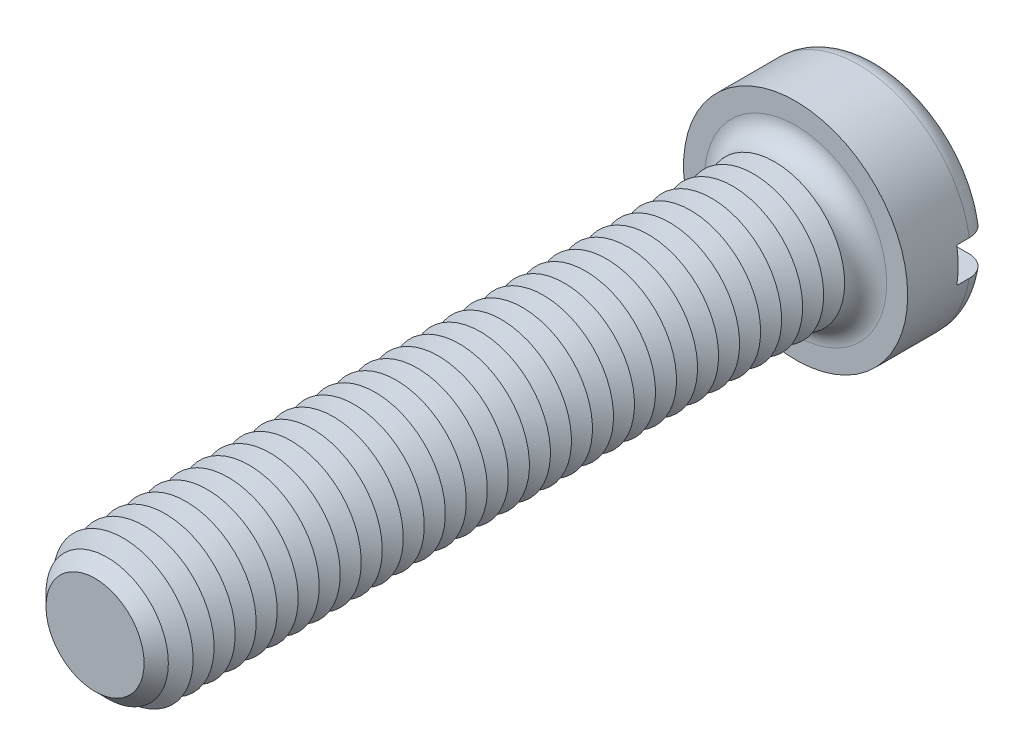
ISO-10303-21;
HEADER;
FILE_DESCRIPTION(('STEP AP214'),'2;1');
FILE_NAME('part.step','',(''),(''),'','','');
FILE_SCHEMA(('AUTOMOTIVE_DESIGN { 1 0 10303 214 1 1 1 1 }'));
ENDSEC;
DATA;
#1=APPLICATION_CONTEXT('core data for automotive mechanical design processes');
#2=APPLICATION_PROTOCOL_DEFINITION('international standard','automotive_design',2000,#1);
#3=PRODUCT_CONTEXT('',#1,'mechanical');
#4=PRODUCT('Part','Part','',(#3));
#5=PRODUCT_RELATED_PRODUCT_CATEGORY('part','',(#4));
#6=PRODUCT_DEFINITION_FORMATION('','',#4);
#7=PRODUCT_DEFINITION_CONTEXT('part definition',#1,'design');
#8=PRODUCT_DEFINITION('design','',#6,#7);
#9=PRODUCT_DEFINITION_SHAPE('','',#8);
#10=(LENGTH_UNIT() NAMED_UNIT(*) SI_UNIT(.MILLI.,.METRE.));
#11=(NAMED_UNIT(*) PLANE_ANGLE_UNIT() SI_UNIT($,.RADIAN.));
#12=(NAMED_UNIT(*) SI_UNIT($,.STERADIAN.) SOLID_ANGLE_UNIT());
#13=UNCERTAINTY_MEASURE_WITH_UNIT(LENGTH_MEASURE(1.E-05),#10,'distance_accuracy_value','');
#14=(GEOMETRIC_REPRESENTATION_CONTEXT(3) GLOBAL_UNCERTAINTY_ASSIGNED_CONTEXT((#13)) GLOBAL_UNIT_ASSIGNED_CONTEXT((#10,
#11,#12)) REPRESENTATION_CONTEXT('',''));
#15=CARTESIAN_POINT('',(0.,0.,0.));
#16=DIRECTION('',(0.,0.,1.));
#17=DIRECTION('',(1.,0.,0.));
#18=AXIS2_PLACEMENT_3D('',#15,#16,#17);
#19=CARTESIAN_POINT('',(0.,0.,-6.));
#20=DIRECTION('',(0.,0.,1.));
#21=DIRECTION('',(1.,0.,0.));
#22=AXIS2_PLACEMENT_3D('',#19,#20,#21);
#23=PLANE('',#22);
#24=CARTESIAN_POINT('',(0.,0.,-6.));
#25=DIRECTION('',(0.,0.,1.));
#26=DIRECTION('',(1.,0.,0.));
#27=AXIS2_PLACEMENT_3D('',#24,#25,#26);
#28=CIRCLE('',#27,6.5);
#29=CARTESIAN_POINT('',(-6.37867541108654,1.25,-6.));
#30=VERTEX_POINT('',#29);
#31=CARTESIAN_POINT('',(6.37867541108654,1.25,-6.));
#32=VERTEX_POINT('',#31);
#33=EDGE_CURVE('E116',#30,#32,#28,.F.);
#34=ORIENTED_EDGE('',*,*,#33,.T.);
#35=DIRECTION('',(1.,0.,0.));
#36=VECTOR('',#35,1.);
#37=CARTESIAN_POINT('',(-8.,1.25,-6.));
#38=LINE('',#37,#36);
#39=EDGE_CURVE('E111',#30,#32,#38,.T.);
#40=ORIENTED_EDGE('',*,*,#39,.F.);
#41=EDGE_LOOP('',(#34,#40));
#42=FACE_BOUND('',#41,.T.);
#43=ADVANCED_FACE('F39',(#42),#23,.F.);
#44=CARTESIAN_POINT('',(0.,0.,-4.5));
#45=DIRECTION('',(0.,0.,1.));
#46=DIRECTION('',(1.,0.,0.));
#47=AXIS2_PLACEMENT_3D('',#44,#45,#46);
#48=TOROIDAL_SURFACE('',#47,6.5,1.5);
#49=CARTESIAN_POINT('',(-7.63778128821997,1.25,-5.34492908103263));
#50=CARTESIAN_POINT('',(-7.58949199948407,1.25,-5.41482553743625));
#51=CARTESIAN_POINT('',(-7.53520056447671,1.25,-5.48065698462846));
#52=CARTESIAN_POINT('',(-7.41624971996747,1.25,-5.60228223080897));
#53=CARTESIAN_POINT('',(-7.35157642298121,1.25,-5.65806236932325));
#54=CARTESIAN_POINT('',(-7.21387612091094,1.25,-5.75795436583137));
#55=CARTESIAN_POINT('',(-7.14085828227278,1.25,-5.80207885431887));
#56=CARTESIAN_POINT('',(-6.98853766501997,1.25,-5.87758013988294));
#57=CARTESIAN_POINT('',(-6.90923642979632,1.25,-5.90896005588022));
#58=CARTESIAN_POINT('',(-6.74565677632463,1.25,-5.95849861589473));
#59=CARTESIAN_POINT('',(-6.66133328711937,1.25,-5.97650838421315));
#60=CARTESIAN_POINT('',(-6.49086565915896,1.25,-5.99833509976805));
#61=CARTESIAN_POINT('',(-6.40472129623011,1.25,-6.00215028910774));
#62=CARTESIAN_POINT('',(-6.23174891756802,1.25,-5.99550457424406));
#63=CARTESIAN_POINT('',(-6.14492874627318,1.25,-5.98483870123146));
#64=CARTESIAN_POINT('',(-5.97427268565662,1.25,-5.94920077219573));
#65=CARTESIAN_POINT('',(-5.89043699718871,1.25,-5.92422775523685));
#66=CARTESIAN_POINT('',(-5.72747580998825,1.25,-5.86041051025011));
#67=CARTESIAN_POINT('',(-5.64839123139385,1.25,-5.8214616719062));
#68=CARTESIAN_POINT('',(-5.49793182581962,1.25,-5.73076137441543));
#69=CARTESIAN_POINT('',(-5.42655700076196,1.25,-5.6790099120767));
#70=CARTESIAN_POINT('',(-5.29410028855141,1.25,-5.56444713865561));
#71=CARTESIAN_POINT('',(-5.23295591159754,1.25,-5.50170815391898));
#72=CARTESIAN_POINT('',(-5.12236155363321,1.25,-5.36664720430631));
#73=CARTESIAN_POINT('',(-5.07291010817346,1.25,-5.29432644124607));
#74=CARTESIAN_POINT('',(-4.98836421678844,1.25,-5.14389152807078));
#75=CARTESIAN_POINT('',(-4.95296843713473,1.25,-5.0659468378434));
#76=CARTESIAN_POINT('',(-4.89620356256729,1.25,-4.90510804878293));
#77=CARTESIAN_POINT('',(-4.87483169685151,1.25,-4.82221493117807));
#78=CARTESIAN_POINT('',(-4.8472995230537,1.25,-4.65636387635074));
#79=CARTESIAN_POINT('',(-4.84072446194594,1.25,-4.57347463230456));
#80=CARTESIAN_POINT('',(-4.84179430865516,1.25,-4.40779255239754));
#81=CARTESIAN_POINT('',(-4.84943782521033,1.25,-4.32499970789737));
#82=CARTESIAN_POINT('',(-4.87846819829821,1.25,-4.16301415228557));
#83=CARTESIAN_POINT('',(-4.89966978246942,1.25,-4.08378809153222));
#84=CARTESIAN_POINT('',(-4.95491528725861,1.25,-3.92995334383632));
#85=CARTESIAN_POINT('',(-4.98895983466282,1.25,-3.85534488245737));
#86=CARTESIAN_POINT('',(-5.06928242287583,1.25,-3.71183790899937));
#87=CARTESIAN_POINT('',(-5.11570495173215,1.25,-3.64302036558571));
#88=CARTESIAN_POINT('',(-5.21915370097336,1.25,-3.51388372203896));
#89=CARTESIAN_POINT('',(-5.27618132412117,1.25,-3.45356574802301));
#90=CARTESIAN_POINT('',(-5.40090076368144,1.25,-3.34137671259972));
#91=CARTESIAN_POINT('',(-5.46884305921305,1.25,-3.28978408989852));
#92=CARTESIAN_POINT('',(-5.61225757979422,1.25,-3.19841811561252));
#93=CARTESIAN_POINT('',(-5.68773079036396,1.25,-3.15864631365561));
#94=CARTESIAN_POINT('',(-5.84602026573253,1.25,-3.09111626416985));
#95=CARTESIAN_POINT('',(-5.92896901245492,1.25,-3.06366820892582));
#96=CARTESIAN_POINT('',(-6.09827849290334,1.25,-3.02294686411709));
#97=CARTESIAN_POINT('',(-6.18463944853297,1.25,-3.00967449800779));
#98=CARTESIAN_POINT('',(-6.35914138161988,1.25,-2.99765063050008));
#99=CARTESIAN_POINT('',(-6.4472913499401,1.25,-2.99902877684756));
#100=CARTESIAN_POINT('',(-6.62209547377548,1.25,-3.01665363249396));
#101=CARTESIAN_POINT('',(-6.70874965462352,1.25,-3.03290008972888));
#102=CARTESIAN_POINT('',(-6.87754008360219,1.25,-3.07975247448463));
#103=CARTESIAN_POINT('',(-6.95969991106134,1.25,-3.11027336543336));
#104=CARTESIAN_POINT('',(-7.11762200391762,1.25,-3.18486653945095));
#105=CARTESIAN_POINT('',(-7.19338469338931,1.25,-3.22893792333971));
#106=CARTESIAN_POINT('',(-7.33522754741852,1.25,-3.32873457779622));
#107=CARTESIAN_POINT('',(-7.40142768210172,1.25,-3.38428930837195));
#108=CARTESIAN_POINT('',(-7.52338344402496,1.25,-3.50587739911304));
#109=CARTESIAN_POINT('',(-7.5791399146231,1.25,-3.57190991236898));
#110=CARTESIAN_POINT('',(-7.67774856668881,1.25,-3.71151097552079));
#111=CARTESIAN_POINT('',(-7.72078137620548,1.25,-3.7849519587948));
#112=CARTESIAN_POINT('',(-7.79373860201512,1.25,-3.93807617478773));
#113=CARTESIAN_POINT('',(-7.82366445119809,1.25,-4.01775872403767));
#114=CARTESIAN_POINT('',(-7.86922494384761,1.25,-4.1801114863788));
#115=CARTESIAN_POINT('',(-7.88502105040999,1.25,-4.26273642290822));
#116=CARTESIAN_POINT('',(-7.90243332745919,1.25,-4.42948977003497));
#117=CARTESIAN_POINT('',(-7.90404643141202,1.25,-4.51361850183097));
#118=CARTESIAN_POINT('',(-7.89306914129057,1.25,-4.68049925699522));
#119=CARTESIAN_POINT('',(-7.88055163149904,1.25,-4.76325613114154));
#120=CARTESIAN_POINT('',(-7.84181179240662,1.25,-4.92542124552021));
#121=CARTESIAN_POINT('',(-7.81560657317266,1.25,-5.00483353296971));
#122=CARTESIAN_POINT('',(-7.76329893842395,1.25,-5.12766777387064));
#123=CARTESIAN_POINT('',(-7.74127773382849,1.25,-5.17287245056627));
#124=CARTESIAN_POINT('',(-7.69279783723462,1.25,-5.26083500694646));
#125=CARTESIAN_POINT('',(-7.66633917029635,1.25,-5.30359290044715));
#126=CARTESIAN_POINT('',(-7.63778128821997,1.25,-5.34492908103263));
#127=B_SPLINE_CURVE_WITH_KNOTS('',3,(#49,#50,#51,#52,#53,#54,#55,#56,#57,#58,#59,#60,#61,#62,
#63,#64,#65,#66,#67,#68,#69,#70,#71,#72,#73,#74,#75,#76,#77,#78,#79,#80,#81,#82,#83,#84,#85,#86,
#87,#88,#89,#90,#91,#92,#93,#94,#95,#96,#97,#98,#99,#100,#101,#102,#103,#104,#105,#106,#107,
#108,#109,#110,#111,#112,#113,#114,#115,#116,#117,#118,#119,#120,#121,#122,#123,#124,#125,#126),
.UNSPECIFIED.,.T.,.F.,(4,2,2,2,2,2,2,2,2,2,2,2,2,2,2,2,2,2,2,2,2,2,2,2,2,2,2,2,2,2,2,2,2,2,2,2,
2,2,4),(0.,0.254678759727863,0.509701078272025,0.764445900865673,1.01912834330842,
1.27660578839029,1.53411511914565,1.7953075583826,2.05651754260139,2.31972495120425,
2.58293242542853,2.84446831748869,3.10597143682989,3.36151874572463,3.61701554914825,
3.86525656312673,4.11347328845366,4.35836855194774,4.60327576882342,4.8511774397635,
5.0991119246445,5.35387584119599,5.60867314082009,5.86956650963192,6.13047687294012,
6.39369803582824,6.65691473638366,6.91858297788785,7.18023385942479,7.43824706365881,
7.69623942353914,7.95037087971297,8.20447454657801,8.45563599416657,8.70685174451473,
8.95677764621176,9.20639187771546,9.35700761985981,9.50762251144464),.UNSPECIFIED.);
#128=CARTESIAN_POINT('',(-7.90174031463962,1.25,-4.50000000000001));
#129=VERTEX_POINT('',#128);
#130=EDGE_CURVE('E441',#129,#30,#127,.T.);
#131=ORIENTED_EDGE('',*,*,#130,.F.);
#132=CARTESIAN_POINT('',(0.,0.,-4.5));
#133=DIRECTION('',(0.,0.,1.));
#134=DIRECTION('',(1.,0.,0.));
#135=AXIS2_PLACEMENT_3D('',#132,#133,#134);
#136=CIRCLE('',#135,8.);
#137=CARTESIAN_POINT('',(7.90174031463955,1.25,-4.5));
#138=VERTEX_POINT('',#137);
#139=EDGE_CURVE('E125',#138,#129,#136,.T.);
#140=ORIENTED_EDGE('',*,*,#139,.F.);
#141=CARTESIAN_POINT('',(4.95236709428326,1.25,-5.05808354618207));
#142=CARTESIAN_POINT('',(4.98477386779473,1.25,-5.13646278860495));
#143=CARTESIAN_POINT('',(5.02397623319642,1.25,-5.21210974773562));
#144=CARTESIAN_POINT('',(5.11464829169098,1.25,-5.35575180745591));
#145=CARTESIAN_POINT('',(5.16613670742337,1.25,-5.42373499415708));
#146=CARTESIAN_POINT('',(5.27963080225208,1.25,-5.55005899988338));
#147=CARTESIAN_POINT('',(5.34161871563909,1.25,-5.60841578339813));
#148=CARTESIAN_POINT('',(5.47431803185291,1.25,-5.71412381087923));
#149=CARTESIAN_POINT('',(5.545027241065,1.25,-5.76147781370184));
#150=CARTESIAN_POINT('',(5.69469818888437,1.25,-5.84486022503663));
#151=CARTESIAN_POINT('',(5.77379661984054,1.25,-5.88064336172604));
#152=CARTESIAN_POINT('',(5.93682776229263,1.25,-5.93863952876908));
#153=CARTESIAN_POINT('',(6.02076112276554,1.25,-5.96085073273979));
#154=CARTESIAN_POINT('',(6.19235911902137,1.25,-5.99130732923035));
#155=CARTESIAN_POINT('',(6.2800597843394,1.25,-5.99935025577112));
#156=CARTESIAN_POINT('',(6.45556807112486,1.25,-6.00057400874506));
#157=CARTESIAN_POINT('',(6.54337569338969,1.25,-5.99375472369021));
#158=CARTESIAN_POINT('',(6.71642471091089,1.25,-5.96539034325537));
#159=CARTESIAN_POINT('',(6.8016703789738,1.25,-5.94387137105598));
#160=CARTESIAN_POINT('',(6.96726399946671,1.25,-5.8866508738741));
#161=CARTESIAN_POINT('',(7.04761223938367,1.25,-5.85095018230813));
#162=CARTESIAN_POINT('',(7.2000703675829,1.25,-5.7668235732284));
#163=CARTESIAN_POINT('',(7.27226868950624,1.25,-5.71855796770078));
#164=CARTESIAN_POINT('',(7.40737382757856,1.25,-5.61041520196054));
#165=CARTESIAN_POINT('',(7.47028138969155,1.25,-5.55053897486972));
#166=CARTESIAN_POINT('',(7.5840004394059,1.25,-5.42185995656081));
#167=CARTESIAN_POINT('',(7.63498189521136,1.25,-5.35320736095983));
#168=CARTESIAN_POINT('',(7.72451646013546,1.25,-5.20822613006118));
#169=CARTESIAN_POINT('',(7.76307051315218,1.25,-5.13189807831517));
#170=CARTESIAN_POINT('',(7.82615156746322,1.25,-4.97479919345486));
#171=CARTESIAN_POINT('',(7.85085353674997,1.25,-4.89409858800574));
#172=CARTESIAN_POINT('',(7.88624162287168,1.25,-4.72968126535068));
#173=CARTESIAN_POINT('',(7.89692844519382,1.25,-4.64596470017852));
#174=CARTESIAN_POINT('',(7.90393395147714,1.25,-4.47857496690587));
#175=CARTESIAN_POINT('',(7.900361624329,1.25,-4.39490633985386));
#176=CARTESIAN_POINT('',(7.8792027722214,1.25,-4.22936201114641));
#177=CARTESIAN_POINT('',(7.86161649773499,1.25,-4.14748627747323));
#178=CARTESIAN_POINT('',(7.81298565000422,1.25,-3.98793539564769));
#179=CARTESIAN_POINT('',(7.78195585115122,1.25,-3.91025574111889));
#180=CARTESIAN_POINT('',(7.70736418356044,1.25,-3.76116938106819));
#181=CARTESIAN_POINT('',(7.66380211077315,1.25,-3.68976277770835));
#182=CARTESIAN_POINT('',(7.56515173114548,1.25,-3.55480889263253));
#183=CARTESIAN_POINT('',(7.51000119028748,1.25,-3.49130712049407));
#184=CARTESIAN_POINT('',(7.38992820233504,1.25,-3.3743390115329));
#185=CARTESIAN_POINT('',(7.32500529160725,1.25,-3.32087315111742));
#186=CARTESIAN_POINT('',(7.18646521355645,1.25,-3.22483712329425));
#187=CARTESIAN_POINT('',(7.11275872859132,1.25,-3.18239583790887));
#188=CARTESIAN_POINT('',(6.95934489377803,1.25,-3.11028530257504));
#189=CARTESIAN_POINT('',(6.87963710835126,1.25,-3.08061698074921));
#190=CARTESIAN_POINT('',(6.71523243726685,1.25,-3.03442872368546));
#191=CARTESIAN_POINT('',(6.63047940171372,1.25,-3.0181086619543));
#192=CARTESIAN_POINT('',(6.45944163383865,1.25,-2.99971307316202));
#193=CARTESIAN_POINT('',(6.37315677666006,1.25,-2.99763871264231));
#194=CARTESIAN_POINT('',(6.20021063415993,1.25,-3.00779604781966));
#195=CARTESIAN_POINT('',(6.11356117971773,1.25,-3.02022976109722));
#196=CARTESIAN_POINT('',(5.94354092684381,1.25,-3.05935975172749));
#197=CARTESIAN_POINT('',(5.86017035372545,1.25,-3.08605700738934));
#198=CARTESIAN_POINT('',(5.69848536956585,1.25,-3.15322746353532));
#199=CARTESIAN_POINT('',(5.62021039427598,1.25,-3.1937956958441));
#200=CARTESIAN_POINT('',(5.47164170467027,1.25,-3.28758816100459));
#201=CARTESIAN_POINT('',(5.40134797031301,1.25,-3.3408123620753));
#202=CARTESIAN_POINT('',(5.27136483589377,1.25,-3.45806317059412));
#203=CARTESIAN_POINT('',(5.21160120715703,1.25,-3.52200740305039));
#204=CARTESIAN_POINT('',(5.10396941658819,1.25,-3.65922833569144));
#205=CARTESIAN_POINT('',(5.05609917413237,1.25,-3.73250340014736));
#206=CARTESIAN_POINT('',(4.97487058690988,1.25,-3.8844714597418));
#207=CARTESIAN_POINT('',(4.94119529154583,1.25,-3.96299495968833));
#208=CARTESIAN_POINT('',(4.88793322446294,1.25,-4.12470694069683));
#209=CARTESIAN_POINT('',(4.86834741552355,1.25,-4.20789574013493));
#210=CARTESIAN_POINT('',(4.84433446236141,1.25,-4.3740749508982));
#211=CARTESIAN_POINT('',(4.83950391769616,1.25,-4.45700748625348));
#212=CARTESIAN_POINT('',(4.84404021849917,1.25,-4.62240731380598));
#213=CARTESIAN_POINT('',(4.85338770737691,1.25,-4.70487508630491));
#214=CARTESIAN_POINT('',(4.87895619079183,1.25,-4.83246978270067));
#215=CARTESIAN_POINT('',(4.89056704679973,1.25,-4.87856970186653));
#216=CARTESIAN_POINT('',(4.91819711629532,1.25,-4.96942661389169));
#217=CARTESIAN_POINT('',(4.93421619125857,1.25,-5.01418364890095));
#218=CARTESIAN_POINT('',(4.95236709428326,1.25,-5.05808354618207));
#219=B_SPLINE_CURVE_WITH_KNOTS('',3,(#141,#142,#143,#144,#145,#146,#147,#148,#149,#150,#151,
#152,#153,#154,#155,#156,#157,#158,#159,#160,#161,#162,#163,#164,#165,#166,#167,#168,#169,#170,
#171,#172,#173,#174,#175,#176,#177,#178,#179,#180,#181,#182,#183,#184,#185,#186,#187,#188,#189,
#190,#191,#192,#193,#194,#195,#196,#197,#198,#199,#200,#201,#202,#203,#204,#205,#206,#207,#208,
#209,#210,#211,#212,#213,#214,#215,#216,#217,#218),.UNSPECIFIED.,.T.,.F.,(4,2,2,2,2,2,2,2,2,2,2,
2,2,2,2,2,2,2,2,2,2,2,2,2,2,2,2,2,2,2,2,2,2,2,2,2,2,2,4),(0.,0.25426396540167,0.508917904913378,
0.763145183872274,1.01730864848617,1.27655188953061,1.53583000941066,1.79878406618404,
2.06174009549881,2.32423003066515,2.5867045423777,2.84598168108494,3.10523799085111,
3.36053725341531,3.61581712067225,3.8677953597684,4.11976091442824,4.36980428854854,
4.61984319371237,4.86960800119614,5.11937687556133,5.37052303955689,5.62168112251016,
5.87565515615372,6.12964764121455,6.38737709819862,6.64512765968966,6.90651052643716,
7.16791132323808,7.43114013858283,7.69436829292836,7.95565940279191,8.21690477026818,
8.47196060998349,8.72703387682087,8.97506819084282,9.22276418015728,9.36518087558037,
9.50759309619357),.UNSPECIFIED.);
#220=EDGE_CURVE('E443',#32,#138,#219,.T.);
#221=ORIENTED_EDGE('',*,*,#220,.F.);
#222=ORIENTED_EDGE('',*,*,#33,.F.);
#223=EDGE_LOOP('',(#131,#140,#221,#222));
#224=FACE_BOUND('',#223,.T.);
#225=ADVANCED_FACE('F425',(#224),#48,.T.);
#226=CARTESIAN_POINT('',(0.,0.,-6.));
#227=DIRECTION('',(0.,0.,1.));
#228=DIRECTION('',(1.,0.,0.));
#229=AXIS2_PLACEMENT_3D('',#226,#227,#228);
#230=CYLINDRICAL_SURFACE('',#229,8.);
#231=DIRECTION('',(0.,0.,1.));
#232=VECTOR('',#231,1.);
#233=CARTESIAN_POINT('',(7.90174031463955,1.25,-6.));
#234=LINE('',#233,#232);
#235=CARTESIAN_POINT('',(7.90174031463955,1.25,-3.6));
#236=VERTEX_POINT('',#235);
#237=EDGE_CURVE('E459',#138,#236,#234,.T.);
#238=ORIENTED_EDGE('',*,*,#237,.F.);
#239=ORIENTED_EDGE('',*,*,#139,.T.);
#240=DIRECTION('',(0.,0.,1.));
#241=VECTOR('',#240,1.);
#242=CARTESIAN_POINT('',(-7.90174031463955,1.25,-6.));
#243=LINE('',#242,#241);
#244=CARTESIAN_POINT('',(-7.90174031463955,1.25,-3.6));
#245=VERTEX_POINT('',#244);
#246=EDGE_CURVE('E63',#245,#129,#243,.F.);
#247=ORIENTED_EDGE('',*,*,#246,.F.);
#248=CARTESIAN_POINT('',(0.,0.,-3.6));
#249=DIRECTION('',(0.,0.,-1.));
#250=DIRECTION('',(-1.,0.,0.));
#251=AXIS2_PLACEMENT_3D('',#248,#249,#250);
#252=CIRCLE('',#251,8.);
#253=CARTESIAN_POINT('',(-7.90174031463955,-1.25,-3.6));
#254=VERTEX_POINT('',#253);
#255=EDGE_CURVE('E43',#245,#254,#252,.F.);
#256=ORIENTED_EDGE('',*,*,#255,.T.);
#257=DIRECTION('',(0.,0.,1.));
#258=VECTOR('',#257,1.);
#259=CARTESIAN_POINT('',(-7.90174031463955,-1.25,-6.));
#260=LINE('',#259,#258);
#261=CARTESIAN_POINT('',(-7.9017403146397,-1.25,-4.49999999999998));
#262=VERTEX_POINT('',#261);
#263=EDGE_CURVE('E456',#262,#254,#260,.T.);
#264=ORIENTED_EDGE('',*,*,#263,.F.);
#265=CARTESIAN_POINT('',(7.90174031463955,-1.25,-4.5));
#266=VERTEX_POINT('',#265);
#267=EDGE_CURVE('E127',#262,#266,#136,.T.);
#268=ORIENTED_EDGE('',*,*,#267,.T.);
#269=DIRECTION('',(0.,0.,1.));
#270=VECTOR('',#269,1.);
#271=CARTESIAN_POINT('',(7.90174031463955,-1.25,-6.));
#272=LINE('',#271,#270);
#273=CARTESIAN_POINT('',(7.90174031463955,-1.25,-3.6));
#274=VERTEX_POINT('',#273);
#275=EDGE_CURVE('E55',#274,#266,#272,.F.);
#276=ORIENTED_EDGE('',*,*,#275,.F.);
#277=EDGE_CURVE('E11',#274,#236,#252,.F.);
#278=ORIENTED_EDGE('',*,*,#277,.T.);
#279=EDGE_LOOP('',(#238,#239,#247,#256,#264,#268,#276,#278));
#280=FACE_BOUND('',#279,.T.);
#281=CARTESIAN_POINT('',(0.,0.,0.));
#282=DIRECTION('',(0.,0.,1.));
#283=DIRECTION('',(1.,0.,0.));
#284=AXIS2_PLACEMENT_3D('',#281,#282,#283);
#285=CIRCLE('',#284,8.);
#286=CARTESIAN_POINT('',(8.,0.,0.));
#287=VERTEX_POINT('',#286);
#288=EDGE_CURVE('E462',#287,#287,#285,.T.);
#289=ORIENTED_EDGE('',*,*,#288,.F.);
#290=EDGE_LOOP('',(#289));
#291=FACE_BOUND('',#290,.T.);
#292=ADVANCED_FACE('F421',(#280,#291),#230,.T.);
#293=CARTESIAN_POINT('',(6.37867541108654,-1.25,-6.));
#294=VERTEX_POINT('',#293);
#295=CARTESIAN_POINT('',(-6.37867541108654,-1.25,-6.));
#296=VERTEX_POINT('',#295);
#297=EDGE_CURVE('E109',#294,#296,#28,.F.);
#298=ORIENTED_EDGE('',*,*,#297,.T.);
#299=DIRECTION('',(-1.,0.,0.));
#300=VECTOR('',#299,1.);
#301=CARTESIAN_POINT('',(-8.,-1.25,-6.));
#302=LINE('',#301,#300);
#303=EDGE_CURVE('E96',#294,#296,#302,.T.);
#304=ORIENTED_EDGE('',*,*,#303,.F.);
#305=EDGE_LOOP('',(#298,#304));
#306=FACE_BOUND('',#305,.T.);
#307=ADVANCED_FACE('F108',(#306),#23,.F.);
#308=CARTESIAN_POINT('',(0.,0.,0.));
#309=DIRECTION('',(0.,0.,1.));
#310=DIRECTION('',(1.,0.,0.));
#311=AXIS2_PLACEMENT_3D('',#308,#309,#310);
#312=PLANE('',#311);
#313=CARTESIAN_POINT('',(0.,0.,0.));
#314=DIRECTION('',(0.,0.,1.));
#315=DIRECTION('',(1.,0.,0.));
#316=AXIS2_PLACEMENT_3D('',#313,#314,#315);
#317=CIRCLE('',#316,6.5);
#318=CARTESIAN_POINT('',(6.5,0.,0.));
#319=VERTEX_POINT('',#318);
#320=EDGE_CURVE('E115',#319,#319,#317,.F.);
#321=ORIENTED_EDGE('',*,*,#320,.T.);
#322=EDGE_LOOP('',(#321));
#323=FACE_BOUND('',#322,.T.);
#324=ORIENTED_EDGE('',*,*,#288,.T.);
#325=EDGE_LOOP('',(#324));
#326=FACE_BOUND('',#325,.T.);
#327=ADVANCED_FACE('F420',(#323,#326),#312,.T.);
#328=CARTESIAN_POINT('',(-7.63778128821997,-1.25,-5.34492908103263));
#329=CARTESIAN_POINT('',(-7.68527581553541,-1.25,-5.27616964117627));
#330=CARTESIAN_POINT('',(-7.72703224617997,-1.25,-5.20337764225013));
#331=CARTESIAN_POINT('',(-7.79778035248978,-1.25,-5.05176511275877));
#332=CARTESIAN_POINT('',(-7.82675823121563,-1.25,-4.97293817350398));
#333=CARTESIAN_POINT('',(-7.87103239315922,-1.25,-4.81153865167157));
#334=CARTESIAN_POINT('',(-7.8863313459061,-1.25,-4.72896680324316));
#335=CARTESIAN_POINT('',(-7.90278562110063,-1.25,-4.56244566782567));
#336=CARTESIAN_POINT('',(-7.90394420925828,-1.25,-4.4784967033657));
#337=CARTESIAN_POINT('',(-7.89211470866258,-1.25,-4.31190980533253));
#338=CARTESIAN_POINT('',(-7.87917806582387,-1.25,-4.22926821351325));
#339=CARTESIAN_POINT('',(-7.8396278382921,-1.25,-4.06732477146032));
#340=CARTESIAN_POINT('',(-7.81301388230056,-1.25,-3.98802301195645));
#341=CARTESIAN_POINT('',(-7.74686575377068,-1.25,-3.83490116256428));
#342=CARTESIAN_POINT('',(-7.70731700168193,-1.25,-3.76108737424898));
#343=CARTESIAN_POINT('',(-7.61647675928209,-1.25,-3.62108231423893));
#344=CARTESIAN_POINT('',(-7.56518496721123,-1.25,-3.55489123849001));
#345=CARTESIAN_POINT('',(-7.45192141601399,-1.25,-3.43145488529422));
#346=CARTESIAN_POINT('',(-7.3898717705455,-1.25,-3.37428109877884));
#347=CARTESIAN_POINT('',(-7.25715883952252,-1.25,-3.27100737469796));
#348=CARTESIAN_POINT('',(-7.18649507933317,-1.25,-3.22490804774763));
#349=CARTESIAN_POINT('',(-7.03760898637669,-1.25,-3.14445316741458));
#350=CARTESIAN_POINT('',(-6.95930204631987,-1.25,-3.1102542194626));
#351=CARTESIAN_POINT('',(-6.79811453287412,-1.25,-3.05526915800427));
#352=CARTESIAN_POINT('',(-6.71523359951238,-1.25,-3.03448410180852));
#353=CARTESIAN_POINT('',(-6.5459165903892,-1.25,-3.006592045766));
#354=CARTESIAN_POINT('',(-6.45944575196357,-1.25,-2.99969602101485));
#355=CARTESIAN_POINT('',(-6.28655568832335,-1.25,-3.00032465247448));
#356=CARTESIAN_POINT('',(-6.20013646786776,-1.25,-3.00785047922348));
#357=CARTESIAN_POINT('',(-6.02865505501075,-1.25,-3.03725742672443));
#358=CARTESIAN_POINT('',(-5.94362352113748,-1.25,-3.05931758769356));
#359=CARTESIAN_POINT('',(-5.77844448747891,-1.25,-3.11735373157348));
#360=CARTESIAN_POINT('',(-5.69829723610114,-1.25,-3.15333042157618));
#361=CARTESIAN_POINT('',(-5.54495924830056,-1.25,-3.23837037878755));
#362=CARTESIAN_POINT('',(-5.47178958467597,-1.25,-3.28747168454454));
#363=CARTESIAN_POINT('',(-5.33486536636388,-1.25,-3.39741183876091));
#364=CARTESIAN_POINT('',(-5.27111040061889,-1.25,-3.45825017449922));
#365=CARTESIAN_POINT('',(-5.15579778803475,-1.25,-3.58914722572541));
#366=CARTESIAN_POINT('',(-5.10409113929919,-1.25,-3.65907455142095));
#367=CARTESIAN_POINT('',(-5.01353659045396,-1.25,-3.8068142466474));
#368=CARTESIAN_POINT('',(-4.97468647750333,-1.25,-3.88462525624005));
#369=CARTESIAN_POINT('',(-4.91208858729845,-1.25,-4.04366636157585));
#370=CARTESIAN_POINT('',(-4.88795969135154,-1.25,-4.12474643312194));
#371=CARTESIAN_POINT('',(-4.85404909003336,-1.25,-4.28985038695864));
#372=CARTESIAN_POINT('',(-4.84426486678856,-1.25,-4.37387374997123));
#373=CARTESIAN_POINT('',(-4.83946276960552,-1.25,-4.54023897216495));
#374=CARTESIAN_POINT('',(-4.8440833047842,-1.25,-4.62257060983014));
#375=CARTESIAN_POINT('',(-4.86713763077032,-1.25,-4.78527148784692));
#376=CARTESIAN_POINT('',(-4.88557092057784,-1.25,-4.86564079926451));
#377=CARTESIAN_POINT('',(-4.9355229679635,-1.25,-5.02189555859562));
#378=CARTESIAN_POINT('',(-4.9669975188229,-1.25,-5.09779517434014));
#379=CARTESIAN_POINT('',(-5.04199393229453,-1.25,-5.24338322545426));
#380=CARTESIAN_POINT('',(-5.0855168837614,-1.25,-5.31307109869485));
#381=CARTESIAN_POINT('',(-5.18427540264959,-1.25,-5.44580979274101));
#382=CARTESIAN_POINT('',(-5.2397318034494,-1.25,-5.50869620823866));
#383=CARTESIAN_POINT('',(-5.36015301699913,-1.25,-5.62458635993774));
#384=CARTESIAN_POINT('',(-5.42511919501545,-1.25,-5.67758867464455));
#385=CARTESIAN_POINT('',(-5.56469412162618,-1.25,-5.7737610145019));
#386=CARTESIAN_POINT('',(-5.6395232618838,-1.25,-5.81661133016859));
#387=CARTESIAN_POINT('',(-5.79521544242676,-1.25,-5.8894110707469));
#388=CARTESIAN_POINT('',(-5.8760791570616,-1.25,-5.91935905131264));
#389=CARTESIAN_POINT('',(-6.04317815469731,-1.25,-5.9660059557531));
#390=CARTESIAN_POINT('',(-6.12948555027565,-1.25,-5.98244700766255));
#391=CARTESIAN_POINT('',(-6.30363462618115,-1.25,-6.00064866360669));
#392=CARTESIAN_POINT('',(-6.39147629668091,-1.25,-6.00240936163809));
#393=CARTESIAN_POINT('',(-6.5664192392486,-1.25,-5.9911248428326));
#394=CARTESIAN_POINT('',(-6.653518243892,-1.25,-5.9780442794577));
#395=CARTESIAN_POINT('',(-6.82426167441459,-1.25,-5.93729204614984));
#396=CARTESIAN_POINT('',(-6.90790538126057,-1.25,-5.90961735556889));
#397=CARTESIAN_POINT('',(-7.06846412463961,-1.25,-5.84071272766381));
#398=CARTESIAN_POINT('',(-7.14543542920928,-1.25,-5.79961377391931));
#399=CARTESIAN_POINT('',(-7.29116896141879,-1.25,-5.70491210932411));
#400=CARTESIAN_POINT('',(-7.35994165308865,-1.25,-5.65132560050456));
#401=CARTESIAN_POINT('',(-7.46362894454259,-1.25,-5.55509815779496));
#402=CARTESIAN_POINT('',(-7.50165191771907,-1.25,-5.51575032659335));
#403=CARTESIAN_POINT('',(-7.57319530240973,-1.25,-5.43315308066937));
#404=CARTESIAN_POINT('',(-7.60671575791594,-1.25,-5.38990370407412));
#405=CARTESIAN_POINT('',(-7.63778128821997,-1.25,-5.34492908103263));
#406=B_SPLINE_CURVE_WITH_KNOTS('',3,(#328,#329,#330,#331,#332,#333,#334,#335,#336,#337,#338,
#339,#340,#341,#342,#343,#344,#345,#346,#347,#348,#349,#350,#351,#352,#353,#354,#355,#356,#357,
#358,#359,#360,#361,#362,#363,#364,#365,#366,#367,#368,#369,#370,#371,#372,#373,#374,#375,#376,
#377,#378,#379,#380,#381,#382,#383,#384,#385,#386,#387,#388,#389,#390,#391,#392,#393,#394,#395,
#396,#397,#398,#399,#400,#401,#402,#403,#404,#405),.UNSPECIFIED.,.T.,.F.,(4,2,2,2,2,2,2,2,2,2,2,
2,2,2,2,2,2,2,2,2,2,2,2,2,2,2,2,2,2,2,2,2,2,2,2,2,2,2,4),(0.,0.250506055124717,
0.501281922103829,0.752008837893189,1.00267784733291,1.25243500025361,1.50219893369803,
1.75224536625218,2.00229822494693,2.25424343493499,2.50620253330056,2.76136198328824,
3.01654154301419,3.27556891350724,3.53461730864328,3.79691797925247,4.05923197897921,
4.32231463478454,4.5853858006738,4.84500678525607,5.10458306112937,5.3571172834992,
5.60960717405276,5.85581050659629,6.10200490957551,6.34737151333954,6.59276029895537,
6.84315522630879,7.09358613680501,7.35108485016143,7.60861238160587,7.87094926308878,
8.13328446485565,8.39624576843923,8.65926152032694,8.91978401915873,9.17997036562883,
9.34382460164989,9.50767723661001),.UNSPECIFIED.);
#407=EDGE_CURVE('E103',#296,#262,#406,.T.);
#408=ORIENTED_EDGE('',*,*,#407,.F.);
#409=ORIENTED_EDGE('',*,*,#297,.F.);
#410=CARTESIAN_POINT('',(4.95236709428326,-1.25,-5.05808354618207));
#411=CARTESIAN_POINT('',(4.92105512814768,-1.25,-4.98233216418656));
#412=CARTESIAN_POINT('',(4.89604361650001,-1.25,-4.90392040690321));
#413=CARTESIAN_POINT('',(4.85951223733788,-1.25,-4.74395758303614));
#414=CARTESIAN_POINT('',(4.8480045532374,-1.25,-4.66240375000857));
#415=CARTESIAN_POINT('',(4.83891469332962,-1.25,-4.49852199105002));
#416=CARTESIAN_POINT('',(4.84133145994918,-1.25,-4.41619412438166));
#417=CARTESIAN_POINT('',(4.8600038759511,-1.25,-4.25314313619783));
#418=CARTESIAN_POINT('',(4.87625705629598,-1.25,-4.17241973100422));
#419=CARTESIAN_POINT('',(4.92196554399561,-1.25,-4.01505032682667));
#420=CARTESIAN_POINT('',(4.95138456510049,-1.25,-3.93839376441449));
#421=CARTESIAN_POINT('',(5.02244158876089,-1.25,-3.79097367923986));
#422=CARTESIAN_POINT('',(5.06408092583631,-1.25,-3.72021080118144));
#423=CARTESIAN_POINT('',(5.15918188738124,-1.25,-3.5851203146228));
#424=CARTESIAN_POINT('',(5.21285223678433,-1.25,-3.5209397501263));
#425=CARTESIAN_POINT('',(5.32993512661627,-1.25,-3.40218700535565));
#426=CARTESIAN_POINT('',(5.39334903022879,-1.25,-3.34761617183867));
#427=CARTESIAN_POINT('',(5.5300552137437,-1.25,-3.24801679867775));
#428=CARTESIAN_POINT('',(5.60357647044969,-1.25,-3.20330242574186));
#429=CARTESIAN_POINT('',(5.75697062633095,-1.25,-3.1265687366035));
#430=CARTESIAN_POINT('',(5.83684424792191,-1.25,-3.09455086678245));
#431=CARTESIAN_POINT('',(6.00239031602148,-1.25,-3.04353393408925));
#432=CARTESIAN_POINT('',(6.08814636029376,-1.25,-3.02480570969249));
#433=CARTESIAN_POINT('',(6.26158564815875,-1.25,-3.00194915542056));
#434=CARTESIAN_POINT('',(6.34926896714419,-1.25,-2.997821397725));
#435=CARTESIAN_POINT('',(6.52441816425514,-1.25,-3.00435236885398));
#436=CARTESIAN_POINT('',(6.61188199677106,-1.25,-3.01506655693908));
#437=CARTESIAN_POINT('',(6.78373130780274,-1.25,-3.05116556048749));
#438=CARTESIAN_POINT('',(6.8681168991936,-1.25,-3.07654983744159));
#439=CARTESIAN_POINT('',(7.03056473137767,-1.25,-3.14105639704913));
#440=CARTESIAN_POINT('',(7.10867812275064,-1.25,-3.18004978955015));
#441=CARTESIAN_POINT('',(7.25711285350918,-1.25,-3.27078804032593));
#442=CARTESIAN_POINT('',(7.327434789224,-1.25,-3.32253192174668));
#443=CARTESIAN_POINT('',(7.45716954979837,-1.25,-3.4364775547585));
#444=CARTESIAN_POINT('',(7.51672925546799,-1.25,-3.49851206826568));
#445=CARTESIAN_POINT('',(7.62440498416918,-1.25,-3.63182557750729));
#446=CARTESIAN_POINT('',(7.67252193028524,-1.25,-3.70310382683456));
#447=CARTESIAN_POINT('',(7.75523498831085,-1.25,-3.8517825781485));
#448=CARTESIAN_POINT('',(7.79001407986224,-1.25,-3.92908131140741));
#449=CARTESIAN_POINT('',(7.84595474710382,-1.25,-4.08845836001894));
#450=CARTESIAN_POINT('',(7.86711715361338,-1.25,-4.1705363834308));
#451=CARTESIAN_POINT('',(7.89503817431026,-1.25,-4.3362768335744));
#452=CARTESIAN_POINT('',(7.90193595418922,-1.25,-4.41991584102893));
#453=CARTESIAN_POINT('',(7.90153623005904,-1.25,-4.58715860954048));
#454=CARTESIAN_POINT('',(7.89423915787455,-1.25,-4.67076237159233));
#455=CARTESIAN_POINT('',(7.86572271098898,-1.25,-4.83525080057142));
#456=CARTESIAN_POINT('',(7.84455307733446,-1.25,-4.91614410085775));
#457=CARTESIAN_POINT('',(7.78897430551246,-1.25,-5.0732444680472));
#458=CARTESIAN_POINT('',(7.75456511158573,-1.25,-5.1494515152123));
#459=CARTESIAN_POINT('',(7.67339923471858,-1.25,-5.29528903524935));
#460=CARTESIAN_POINT('',(7.62660424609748,-1.25,-5.36489817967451));
#461=CARTESIAN_POINT('',(7.52209201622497,-1.25,-5.49536318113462));
#462=CARTESIAN_POINT('',(7.4643743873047,-1.25,-5.55621872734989));
#463=CARTESIAN_POINT('',(7.33909994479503,-1.25,-5.66807257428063));
#464=CARTESIAN_POINT('',(7.27145672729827,-1.25,-5.71897407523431));
#465=CARTESIAN_POINT('',(7.12868060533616,-1.25,-5.80887807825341));
#466=CARTESIAN_POINT('',(7.0535472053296,-1.25,-5.84787979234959));
#467=CARTESIAN_POINT('',(6.89682225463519,-1.25,-5.91345911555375));
#468=CARTESIAN_POINT('',(6.81515596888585,-1.25,-5.93985808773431));
#469=CARTESIAN_POINT('',(6.64858434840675,-1.25,-5.97879449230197));
#470=CARTESIAN_POINT('',(6.56367874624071,-1.25,-5.99133077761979));
#471=CARTESIAN_POINT('',(6.39168259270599,-1.25,-6.00236627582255));
#472=CARTESIAN_POINT('',(6.30457835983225,-1.25,-6.00065255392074));
#473=CARTESIAN_POINT('',(6.13186422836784,-1.25,-5.98278857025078));
#474=CARTESIAN_POINT('',(6.04625438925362,-1.25,-5.96663773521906));
#475=CARTESIAN_POINT('',(5.87802521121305,-1.25,-5.92012173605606));
#476=CARTESIAN_POINT('',(5.79544617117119,-1.25,-5.88961066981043));
#477=CARTESIAN_POINT('',(5.63656223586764,-1.25,-5.81513349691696));
#478=CARTESIAN_POINT('',(5.56025908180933,-1.25,-5.77116367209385));
#479=CARTESIAN_POINT('',(5.4162607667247,-1.25,-5.67098882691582));
#480=CARTESIAN_POINT('',(5.34855795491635,-1.25,-5.61479480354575));
#481=CARTESIAN_POINT('',(5.22382615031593,-1.25,-5.49168804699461));
#482=CARTESIAN_POINT('',(5.16678340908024,-1.25,-5.42478932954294));
#483=CARTESIAN_POINT('',(5.08326589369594,-1.25,-5.3075481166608));
#484=CARTESIAN_POINT('',(5.05313168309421,-1.25,-5.25976959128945));
#485=CARTESIAN_POINT('',(4.99845900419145,-1.25,-5.16110869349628));
#486=CARTESIAN_POINT('',(4.9739204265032,-1.25,-5.11022638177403));
#487=CARTESIAN_POINT('',(4.95236709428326,-1.25,-5.05808354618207));
#488=B_SPLINE_CURVE_WITH_KNOTS('',3,(#410,#411,#412,#413,#414,#415,#416,#417,#418,#419,#420,
#421,#422,#423,#424,#425,#426,#427,#428,#429,#430,#431,#432,#433,#434,#435,#436,#437,#438,#439,
#440,#441,#442,#443,#444,#445,#446,#447,#448,#449,#450,#451,#452,#453,#454,#455,#456,#457,#458,
#459,#460,#461,#462,#463,#464,#465,#466,#467,#468,#469,#470,#471,#472,#473,#474,#475,#476,#477,
#478,#479,#480,#481,#482,#483,#484,#485,#486,#487),.UNSPECIFIED.,.T.,.F.,(4,2,2,2,2,2,2,2,2,2,2,
2,2,2,2,2,2,2,2,2,2,2,2,2,2,2,2,2,2,2,2,2,2,2,2,2,2,2,4),(0.,0.245701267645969,
0.491624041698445,0.737528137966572,0.983388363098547,1.22857510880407,1.47378864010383,
1.72364048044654,1.97352730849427,2.2304941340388,2.48749022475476,2.74958408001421,
3.01168820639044,3.2747743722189,3.53785088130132,3.79850056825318,4.05913029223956,
4.31587819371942,4.57260537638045,4.82567253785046,5.07872425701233,5.32929532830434,
5.57985877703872,5.82952869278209,6.07919966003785,6.32965199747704,6.58011322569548,
6.8329006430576,7.08570479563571,7.3419930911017,7.59830259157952,7.85844887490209,
8.11860548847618,8.38146435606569,8.64439590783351,8.90709189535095,9.16944670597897,
9.33857644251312,9.5077028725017),.UNSPECIFIED.);
#489=EDGE_CURVE('E92',#266,#294,#488,.T.);
#490=ORIENTED_EDGE('',*,*,#489,.F.);
#491=ORIENTED_EDGE('',*,*,#267,.F.);
#492=EDGE_LOOP('',(#408,#409,#490,#491));
#493=FACE_BOUND('',#492,.T.);
#494=ADVANCED_FACE('F113',(#493),#48,.T.);
#495=CARTESIAN_POINT('',(0.,0.,1.5));
#496=DIRECTION('',(0.,0.,1.));
#497=DIRECTION('',(1.,0.,0.));
#498=AXIS2_PLACEMENT_3D('',#495,#496,#497);
#499=TOROIDAL_SURFACE('',#498,6.5,1.5);
#500=ORIENTED_EDGE('',*,*,#320,.F.);
#501=EDGE_LOOP('',(#500));
#502=FACE_BOUND('',#501,.T.);
#503=CARTESIAN_POINT('',(0.,0.,1.50000000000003));
#504=DIRECTION('',(0.,0.,-1.));
#505=DIRECTION('',(-1.,0.,0.));
#506=AXIS2_PLACEMENT_3D('',#503,#504,#505);
#507=CIRCLE('',#506,5.);
#508=CARTESIAN_POINT('',(-5.,0.,1.50000000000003));
#509=VERTEX_POINT('',#508);
#510=EDGE_CURVE('E468',#509,#509,#507,.T.);
#511=ORIENTED_EDGE('',*,*,#510,.T.);
#512=EDGE_LOOP('',(#511));
#513=FACE_BOUND('',#512,.T.);
#514=ADVANCED_FACE('F413',(#502,#513),#499,.F.);
#515=CARTESIAN_POINT('',(0.,0.,2.25000000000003));
#516=DIRECTION('',(0.,0.,-1.));
#517=DIRECTION('',(-1.,0.,0.));
#518=AXIS2_PLACEMENT_3D('',#515,#516,#517);
#519=CONICAL_SURFACE('',#518,3.70096189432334,1.0471975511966);
#520=ORIENTED_EDGE('',*,*,#510,.F.);
#521=EDGE_LOOP('',(#520));
#522=FACE_BOUND('',#521,.T.);
#523=CARTESIAN_POINT('',(0.,0.,2.25000000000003));
#524=DIRECTION('',(0.,0.,-1.));
#525=DIRECTION('',(-1.,0.,0.));
#526=AXIS2_PLACEMENT_3D('',#523,#524,#525);
#527=CIRCLE('',#526,3.70096189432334);
#528=CARTESIAN_POINT('',(-3.70096189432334,0.,2.25000000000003));
#529=VERTEX_POINT('',#528);
#530=EDGE_CURVE('E473',#529,#529,#527,.T.);
#531=ORIENTED_EDGE('',*,*,#530,.T.);
#532=EDGE_LOOP('',(#531));
#533=FACE_BOUND('',#532,.T.);
#534=ADVANCED_FACE('F409',(#522,#533),#519,.T.);
#535=CARTESIAN_POINT('',(0.,0.,3.00000000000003));
#536=DIRECTION('',(0.,0.,1.));
#537=DIRECTION('',(1.,0.,0.));
#538=AXIS2_PLACEMENT_3D('',#535,#536,#537);
#539=CONICAL_SURFACE('',#538,5.,1.0471975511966);
#540=ORIENTED_EDGE('',*,*,#530,.F.);
#541=EDGE_LOOP('',(#540));
#542=FACE_BOUND('',#541,.T.);
#543=CARTESIAN_POINT('',(0.,0.,3.00000000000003));
#544=DIRECTION('',(0.,0.,-1.));
#545=DIRECTION('',(-1.,0.,0.));
#546=AXIS2_PLACEMENT_3D('',#543,#544,#545);
#547=CIRCLE('',#546,5.);
#548=CARTESIAN_POINT('',(-5.,0.,3.00000000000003));
#549=VERTEX_POINT('',#548);
#550=EDGE_CURVE('E479',#549,#549,#547,.T.);
#551=ORIENTED_EDGE('',*,*,#550,.T.);
#552=EDGE_LOOP('',(#551));
#553=FACE_BOUND('',#552,.T.);
#554=ADVANCED_FACE('F405',(#542,#553),#539,.T.);
#555=CARTESIAN_POINT('',(0.,0.,3.75000000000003));
#556=DIRECTION('',(0.,0.,-1.));
#557=DIRECTION('',(-1.,0.,0.));
#558=AXIS2_PLACEMENT_3D('',#555,#556,#557);
#559=CONICAL_SURFACE('',#558,3.70096189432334,1.0471975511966);
#560=ORIENTED_EDGE('',*,*,#550,.F.);
#561=EDGE_LOOP('',(#560));
#562=FACE_BOUND('',#561,.T.);
#563=CARTESIAN_POINT('',(0.,0.,3.75000000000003));
#564=DIRECTION('',(0.,0.,-1.));
#565=DIRECTION('',(-1.,0.,0.));
#566=AXIS2_PLACEMENT_3D('',#563,#564,#565);
#567=CIRCLE('',#566,3.70096189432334);
#568=CARTESIAN_POINT('',(-3.70096189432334,0.,3.75000000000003));
#569=VERTEX_POINT('',#568);
#570=EDGE_CURVE('E483',#569,#569,#567,.T.);
#571=ORIENTED_EDGE('',*,*,#570,.T.);
#572=EDGE_LOOP('',(#571));
#573=FACE_BOUND('',#572,.T.);
#574=ADVANCED_FACE('F401',(#562,#573),#559,.T.);
#575=CARTESIAN_POINT('',(0.,0.,4.50000000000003));
#576=DIRECTION('',(0.,0.,1.));
#577=DIRECTION('',(1.,0.,0.));
#578=AXIS2_PLACEMENT_3D('',#575,#576,#577);
#579=CONICAL_SURFACE('',#578,5.,1.0471975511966);
#580=ORIENTED_EDGE('',*,*,#570,.F.);
#581=EDGE_LOOP('',(#580));
#582=FACE_BOUND('',#581,.T.);
#583=CARTESIAN_POINT('',(0.,0.,4.50000000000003));
#584=DIRECTION('',(0.,0.,-1.));
#585=DIRECTION('',(-1.,0.,0.));
#586=AXIS2_PLACEMENT_3D('',#583,#584,#585);
#587=CIRCLE('',#586,5.);
#588=CARTESIAN_POINT('',(-5.,0.,4.50000000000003));
#589=VERTEX_POINT('',#588);
#590=EDGE_CURVE('E487',#589,#589,#587,.T.);
#591=ORIENTED_EDGE('',*,*,#590,.T.);
#592=EDGE_LOOP('',(#591));
#593=FACE_BOUND('',#592,.T.);
#594=ADVANCED_FACE('F397',(#582,#593),#579,.T.);
#595=CARTESIAN_POINT('',(0.,0.,5.25000000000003));
#596=DIRECTION('',(0.,0.,-1.));
#597=DIRECTION('',(-1.,0.,0.));
#598=AXIS2_PLACEMENT_3D('',#595,#596,#597);
#599=CONICAL_SURFACE('',#598,3.70096189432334,1.0471975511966);
#600=ORIENTED_EDGE('',*,*,#590,.F.);
#601=EDGE_LOOP('',(#600));
#602=FACE_BOUND('',#601,.T.);
#603=CARTESIAN_POINT('',(0.,0.,5.25000000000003));
#604=DIRECTION('',(0.,0.,-1.));
#605=DIRECTION('',(-1.,0.,0.));
#606=AXIS2_PLACEMENT_3D('',#603,#604,#605);
#607=CIRCLE('',#606,3.70096189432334);
#608=CARTESIAN_POINT('',(-3.70096189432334,0.,5.25000000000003));
#609=VERTEX_POINT('',#608);
#610=EDGE_CURVE('E491',#609,#609,#607,.T.);
#611=ORIENTED_EDGE('',*,*,#610,.T.);
#612=EDGE_LOOP('',(#611));
#613=FACE_BOUND('',#612,.T.);
#614=ADVANCED_FACE('F393',(#602,#613),#599,.T.);
#615=CARTESIAN_POINT('',(0.,0.,6.00000000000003));
#616=DIRECTION('',(0.,0.,1.));
#617=DIRECTION('',(1.,0.,0.));
#618=AXIS2_PLACEMENT_3D('',#615,#616,#617);
#619=CONICAL_SURFACE('',#618,5.,1.0471975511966);
#620=ORIENTED_EDGE('',*,*,#610,.F.);
#621=EDGE_LOOP('',(#620));
#622=FACE_BOUND('',#621,.T.);
#623=CARTESIAN_POINT('',(0.,0.,6.00000000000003));
#624=DIRECTION('',(0.,0.,-1.));
#625=DIRECTION('',(-1.,0.,0.));
#626=AXIS2_PLACEMENT_3D('',#623,#624,#625);
#627=CIRCLE('',#626,5.);
#628=CARTESIAN_POINT('',(-5.,0.,6.00000000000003));
#629=VERTEX_POINT('',#628);
#630=EDGE_CURVE('E494',#629,#629,#627,.T.);
#631=ORIENTED_EDGE('',*,*,#630,.T.);
#632=EDGE_LOOP('',(#631));
#633=FACE_BOUND('',#632,.T.);
#634=ADVANCED_FACE('F389',(#622,#633),#619,.T.);
#635=CARTESIAN_POINT('',(0.,0.,6.75000000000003));
#636=DIRECTION('',(0.,0.,-1.));
#637=DIRECTION('',(-1.,0.,0.));
#638=AXIS2_PLACEMENT_3D('',#635,#636,#637);
#639=CONICAL_SURFACE('',#638,3.70096189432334,1.0471975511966);
#640=ORIENTED_EDGE('',*,*,#630,.F.);
#641=EDGE_LOOP('',(#640));
#642=FACE_BOUND('',#641,.T.);
#643=CARTESIAN_POINT('',(0.,0.,6.75000000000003));
#644=DIRECTION('',(0.,0.,-1.));
#645=DIRECTION('',(-1.,0.,0.));
#646=AXIS2_PLACEMENT_3D('',#643,#644,#645);
#647=CIRCLE('',#646,3.70096189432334);
#648=CARTESIAN_POINT('',(-3.70096189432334,0.,6.75000000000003));
#649=VERTEX_POINT('',#648);
#650=EDGE_CURVE('E498',#649,#649,#647,.T.);
#651=ORIENTED_EDGE('',*,*,#650,.T.);
#652=EDGE_LOOP('',(#651));
#653=FACE_BOUND('',#652,.T.);
#654=ADVANCED_FACE('F385',(#642,#653),#639,.T.);
#655=CARTESIAN_POINT('',(0.,0.,7.50000000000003));
#656=DIRECTION('',(0.,0.,1.));
#657=DIRECTION('',(1.,0.,0.));
#658=AXIS2_PLACEMENT_3D('',#655,#656,#657);
#659=CONICAL_SURFACE('',#658,5.,1.0471975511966);
#660=ORIENTED_EDGE('',*,*,#650,.F.);
#661=EDGE_LOOP('',(#660));
#662=FACE_BOUND('',#661,.T.);
#663=CARTESIAN_POINT('',(0.,0.,7.50000000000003));
#664=DIRECTION('',(0.,0.,-1.));
#665=DIRECTION('',(-1.,0.,0.));
#666=AXIS2_PLACEMENT_3D('',#663,#664,#665);
#667=CIRCLE('',#666,5.);
#668=CARTESIAN_POINT('',(-5.,0.,7.50000000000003));
#669=VERTEX_POINT('',#668);
#670=EDGE_CURVE('E501',#669,#669,#667,.T.);
#671=ORIENTED_EDGE('',*,*,#670,.T.);
#672=EDGE_LOOP('',(#671));
#673=FACE_BOUND('',#672,.T.);
#674=ADVANCED_FACE('F381',(#662,#673),#659,.T.);
#675=CARTESIAN_POINT('',(0.,0.,8.25000000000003));
#676=DIRECTION('',(0.,0.,-1.));
#677=DIRECTION('',(-1.,0.,0.));
#678=AXIS2_PLACEMENT_3D('',#675,#676,#677);
#679=CONICAL_SURFACE('',#678,3.70096189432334,1.0471975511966);
#680=ORIENTED_EDGE('',*,*,#670,.F.);
#681=EDGE_LOOP('',(#680));
#682=FACE_BOUND('',#681,.T.);
#683=CARTESIAN_POINT('',(0.,0.,8.25000000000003));
#684=DIRECTION('',(0.,0.,-1.));
#685=DIRECTION('',(-1.,0.,0.));
#686=AXIS2_PLACEMENT_3D('',#683,#684,#685);
#687=CIRCLE('',#686,3.70096189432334);
#688=CARTESIAN_POINT('',(-3.70096189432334,0.,8.25000000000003));
#689=VERTEX_POINT('',#688);
#690=EDGE_CURVE('E504',#689,#689,#687,.T.);
#691=ORIENTED_EDGE('',*,*,#690,.T.);
#692=EDGE_LOOP('',(#691));
#693=FACE_BOUND('',#692,.T.);
#694=ADVANCED_FACE('F377',(#682,#693),#679,.T.);
#695=CARTESIAN_POINT('',(0.,0.,9.00000000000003));
#696=DIRECTION('',(0.,0.,1.));
#697=DIRECTION('',(1.,0.,0.));
#698=AXIS2_PLACEMENT_3D('',#695,#696,#697);
#699=CONICAL_SURFACE('',#698,5.,1.0471975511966);
#700=ORIENTED_EDGE('',*,*,#690,.F.);
#701=EDGE_LOOP('',(#700));
#702=FACE_BOUND('',#701,.T.);
#703=CARTESIAN_POINT('',(0.,0.,9.00000000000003));
#704=DIRECTION('',(0.,0.,-1.));
#705=DIRECTION('',(-1.,0.,0.));
#706=AXIS2_PLACEMENT_3D('',#703,#704,#705);
#707=CIRCLE('',#706,5.);
#708=CARTESIAN_POINT('',(-5.,0.,9.00000000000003));
#709=VERTEX_POINT('',#708);
#710=EDGE_CURVE('E508',#709,#709,#707,.T.);
#711=ORIENTED_EDGE('',*,*,#710,.T.);
#712=EDGE_LOOP('',(#711));
#713=FACE_BOUND('',#712,.T.);
#714=ADVANCED_FACE('F373',(#702,#713),#699,.T.);
#715=CARTESIAN_POINT('',(0.,0.,9.75000000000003));
#716=DIRECTION('',(0.,0.,-1.));
#717=DIRECTION('',(-1.,0.,0.));
#718=AXIS2_PLACEMENT_3D('',#715,#716,#717);
#719=CONICAL_SURFACE('',#718,3.70096189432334,1.0471975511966);
#720=ORIENTED_EDGE('',*,*,#710,.F.);
#721=EDGE_LOOP('',(#720));
#722=FACE_BOUND('',#721,.T.);
#723=CARTESIAN_POINT('',(0.,0.,9.75000000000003));
#724=DIRECTION('',(0.,0.,-1.));
#725=DIRECTION('',(-1.,0.,0.));
#726=AXIS2_PLACEMENT_3D('',#723,#724,#725);
#727=CIRCLE('',#726,3.70096189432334);
#728=CARTESIAN_POINT('',(-3.70096189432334,0.,9.75000000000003));
#729=VERTEX_POINT('',#728);
#730=EDGE_CURVE('E512',#729,#729,#727,.T.);
#731=ORIENTED_EDGE('',*,*,#730,.T.);
#732=EDGE_LOOP('',(#731));
#733=FACE_BOUND('',#732,.T.);
#734=ADVANCED_FACE('F369',(#722,#733),#719,.T.);
#735=CARTESIAN_POINT('',(0.,0.,10.5));
#736=DIRECTION('',(0.,0.,1.));
#737=DIRECTION('',(1.,0.,0.));
#738=AXIS2_PLACEMENT_3D('',#735,#736,#737);
#739=CONICAL_SURFACE('',#738,5.,1.0471975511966);
#740=ORIENTED_EDGE('',*,*,#730,.F.);
#741=EDGE_LOOP('',(#740));
#742=FACE_BOUND('',#741,.T.);
#743=CARTESIAN_POINT('',(0.,0.,10.5));
#744=DIRECTION('',(0.,0.,-1.));
#745=DIRECTION('',(-1.,0.,0.));
#746=AXIS2_PLACEMENT_3D('',#743,#744,#745);
#747=CIRCLE('',#746,5.);
#748=CARTESIAN_POINT('',(-5.,0.,10.5));
#749=VERTEX_POINT('',#748);
#750=EDGE_CURVE('E515',#749,#749,#747,.T.);
#751=ORIENTED_EDGE('',*,*,#750,.T.);
#752=EDGE_LOOP('',(#751));
#753=FACE_BOUND('',#752,.T.);
#754=ADVANCED_FACE('F365',(#742,#753),#739,.T.);
#755=CARTESIAN_POINT('',(0.,0.,11.25));
#756=DIRECTION('',(0.,0.,-1.));
#757=DIRECTION('',(-1.,0.,0.));
#758=AXIS2_PLACEMENT_3D('',#755,#756,#757);
#759=CONICAL_SURFACE('',#758,3.70096189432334,1.0471975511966);
#760=ORIENTED_EDGE('',*,*,#750,.F.);
#761=EDGE_LOOP('',(#760));
#762=FACE_BOUND('',#761,.T.);
#763=CARTESIAN_POINT('',(0.,0.,11.25));
#764=DIRECTION('',(0.,0.,-1.));
#765=DIRECTION('',(-1.,0.,0.));
#766=AXIS2_PLACEMENT_3D('',#763,#764,#765);
#767=CIRCLE('',#766,3.70096189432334);
#768=CARTESIAN_POINT('',(-3.70096189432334,0.,11.25));
#769=VERTEX_POINT('',#768);
#770=EDGE_CURVE('E519',#769,#769,#767,.T.);
#771=ORIENTED_EDGE('',*,*,#770,.T.);
#772=EDGE_LOOP('',(#771));
#773=FACE_BOUND('',#772,.T.);
#774=ADVANCED_FACE('F361',(#762,#773),#759,.T.);
#775=CARTESIAN_POINT('',(0.,0.,12.));
#776=DIRECTION('',(0.,0.,1.));
#777=DIRECTION('',(1.,0.,0.));
#778=AXIS2_PLACEMENT_3D('',#775,#776,#777);
#779=CONICAL_SURFACE('',#778,5.,1.0471975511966);
#780=ORIENTED_EDGE('',*,*,#770,.F.);
#781=EDGE_LOOP('',(#780));
#782=FACE_BOUND('',#781,.T.);
#783=CARTESIAN_POINT('',(0.,0.,12.));
#784=DIRECTION('',(0.,0.,-1.));
#785=DIRECTION('',(-1.,0.,0.));
#786=AXIS2_PLACEMENT_3D('',#783,#784,#785);
#787=CIRCLE('',#786,5.);
#788=CARTESIAN_POINT('',(-5.,0.,12.));
#789=VERTEX_POINT('',#788);
#790=EDGE_CURVE('E523',#789,#789,#787,.T.);
#791=ORIENTED_EDGE('',*,*,#790,.T.);
#792=EDGE_LOOP('',(#791));
#793=FACE_BOUND('',#792,.T.);
#794=ADVANCED_FACE('F357',(#782,#793),#779,.T.);
#795=CARTESIAN_POINT('',(0.,0.,12.75));
#796=DIRECTION('',(0.,0.,-1.));
#797=DIRECTION('',(-1.,0.,0.));
#798=AXIS2_PLACEMENT_3D('',#795,#796,#797);
#799=CONICAL_SURFACE('',#798,3.70096189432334,1.0471975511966);
#800=ORIENTED_EDGE('',*,*,#790,.F.);
#801=EDGE_LOOP('',(#800));
#802=FACE_BOUND('',#801,.T.);
#803=CARTESIAN_POINT('',(0.,0.,12.75));
#804=DIRECTION('',(0.,0.,-1.));
#805=DIRECTION('',(-1.,0.,0.));
#806=AXIS2_PLACEMENT_3D('',#803,#804,#805);
#807=CIRCLE('',#806,3.70096189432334);
#808=CARTESIAN_POINT('',(-3.70096189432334,0.,12.75));
#809=VERTEX_POINT('',#808);
#810=EDGE_CURVE('E527',#809,#809,#807,.T.);
#811=ORIENTED_EDGE('',*,*,#810,.T.);
#812=EDGE_LOOP('',(#811));
#813=FACE_BOUND('',#812,.T.);
#814=ADVANCED_FACE('F353',(#802,#813),#799,.T.);
#815=CARTESIAN_POINT('',(0.,0.,13.5));
#816=DIRECTION('',(0.,0.,1.));
#817=DIRECTION('',(1.,0.,0.));
#818=AXIS2_PLACEMENT_3D('',#815,#816,#817);
#819=CONICAL_SURFACE('',#818,5.,1.0471975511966);
#820=ORIENTED_EDGE('',*,*,#810,.F.);
#821=EDGE_LOOP('',(#820));
#822=FACE_BOUND('',#821,.T.);
#823=CARTESIAN_POINT('',(0.,0.,13.5));
#824=DIRECTION('',(0.,0.,-1.));
#825=DIRECTION('',(-1.,0.,0.));
#826=AXIS2_PLACEMENT_3D('',#823,#824,#825);
#827=CIRCLE('',#826,5.);
#828=CARTESIAN_POINT('',(-5.,0.,13.5));
#829=VERTEX_POINT('',#828);
#830=EDGE_CURVE('E531',#829,#829,#827,.T.);
#831=ORIENTED_EDGE('',*,*,#830,.T.);
#832=EDGE_LOOP('',(#831));
#833=FACE_BOUND('',#832,.T.);
#834=ADVANCED_FACE('F349',(#822,#833),#819,.T.);
#835=CARTESIAN_POINT('',(0.,0.,14.25));
#836=DIRECTION('',(0.,0.,-1.));
#837=DIRECTION('',(-1.,0.,0.));
#838=AXIS2_PLACEMENT_3D('',#835,#836,#837);
#839=CONICAL_SURFACE('',#838,3.70096189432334,1.0471975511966);
#840=ORIENTED_EDGE('',*,*,#830,.F.);
#841=EDGE_LOOP('',(#840));
#842=FACE_BOUND('',#841,.T.);
#843=CARTESIAN_POINT('',(0.,0.,14.25));
#844=DIRECTION('',(0.,0.,-1.));
#845=DIRECTION('',(-1.,0.,0.));
#846=AXIS2_PLACEMENT_3D('',#843,#844,#845);
#847=CIRCLE('',#846,3.70096189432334);
#848=CARTESIAN_POINT('',(-3.70096189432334,0.,14.25));
#849=VERTEX_POINT('',#848);
#850=EDGE_CURVE('E535',#849,#849,#847,.T.);
#851=ORIENTED_EDGE('',*,*,#850,.T.);
#852=EDGE_LOOP('',(#851));
#853=FACE_BOUND('',#852,.T.);
#854=ADVANCED_FACE('F345',(#842,#853),#839,.T.);
#855=CARTESIAN_POINT('',(0.,0.,15.));
#856=DIRECTION('',(0.,0.,1.));
#857=DIRECTION('',(1.,0.,0.));
#858=AXIS2_PLACEMENT_3D('',#855,#856,#857);
#859=CONICAL_SURFACE('',#858,5.,1.0471975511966);
#860=ORIENTED_EDGE('',*,*,#850,.F.);
#861=EDGE_LOOP('',(#860));
#862=FACE_BOUND('',#861,.T.);
#863=CARTESIAN_POINT('',(0.,0.,15.));
#864=DIRECTION('',(0.,0.,-1.));
#865=DIRECTION('',(-1.,0.,0.));
#866=AXIS2_PLACEMENT_3D('',#863,#864,#865);
#867=CIRCLE('',#866,5.);
#868=CARTESIAN_POINT('',(-5.,0.,15.));
#869=VERTEX_POINT('',#868);
#870=EDGE_CURVE('E539',#869,#869,#867,.T.);
#871=ORIENTED_EDGE('',*,*,#870,.T.);
#872=EDGE_LOOP('',(#871));
#873=FACE_BOUND('',#872,.T.);
#874=ADVANCED_FACE('F341',(#862,#873),#859,.T.);
#875=CARTESIAN_POINT('',(0.,0.,15.75));
#876=DIRECTION('',(0.,0.,-1.));
#877=DIRECTION('',(-1.,0.,0.));
#878=AXIS2_PLACEMENT_3D('',#875,#876,#877);
#879=CONICAL_SURFACE('',#878,3.70096189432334,1.0471975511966);
#880=ORIENTED_EDGE('',*,*,#870,.F.);
#881=EDGE_LOOP('',(#880));
#882=FACE_BOUND('',#881,.T.);
#883=CARTESIAN_POINT('',(0.,0.,15.75));
#884=DIRECTION('',(0.,0.,-1.));
#885=DIRECTION('',(-1.,0.,0.));
#886=AXIS2_PLACEMENT_3D('',#883,#884,#885);
#887=CIRCLE('',#886,3.70096189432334);
#888=CARTESIAN_POINT('',(-3.70096189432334,0.,15.75));
#889=VERTEX_POINT('',#888);
#890=EDGE_CURVE('E543',#889,#889,#887,.T.);
#891=ORIENTED_EDGE('',*,*,#890,.T.);
#892=EDGE_LOOP('',(#891));
#893=FACE_BOUND('',#892,.T.);
#894=ADVANCED_FACE('F337',(#882,#893),#879,.T.);
#895=CARTESIAN_POINT('',(0.,0.,16.5));
#896=DIRECTION('',(0.,0.,1.));
#897=DIRECTION('',(1.,0.,0.));
#898=AXIS2_PLACEMENT_3D('',#895,#896,#897);
#899=CONICAL_SURFACE('',#898,5.,1.0471975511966);
#900=ORIENTED_EDGE('',*,*,#890,.F.);
#901=EDGE_LOOP('',(#900));
#902=FACE_BOUND('',#901,.T.);
#903=CARTESIAN_POINT('',(0.,0.,16.5));
#904=DIRECTION('',(0.,0.,-1.));
#905=DIRECTION('',(-1.,0.,0.));
#906=AXIS2_PLACEMENT_3D('',#903,#904,#905);
#907=CIRCLE('',#906,5.);
#908=CARTESIAN_POINT('',(-5.,0.,16.5));
#909=VERTEX_POINT('',#908);
#910=EDGE_CURVE('E547',#909,#909,#907,.T.);
#911=ORIENTED_EDGE('',*,*,#910,.T.);
#912=EDGE_LOOP('',(#911));
#913=FACE_BOUND('',#912,.T.);
#914=ADVANCED_FACE('F333',(#902,#913),#899,.T.);
#915=CARTESIAN_POINT('',(0.,0.,17.25));
#916=DIRECTION('',(0.,0.,-1.));
#917=DIRECTION('',(-1.,0.,0.));
#918=AXIS2_PLACEMENT_3D('',#915,#916,#917);
#919=CONICAL_SURFACE('',#918,3.70096189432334,1.0471975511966);
#920=ORIENTED_EDGE('',*,*,#910,.F.);
#921=EDGE_LOOP('',(#920));
#922=FACE_BOUND('',#921,.T.);
#923=CARTESIAN_POINT('',(0.,0.,17.25));
#924=DIRECTION('',(0.,0.,-1.));
#925=DIRECTION('',(-1.,0.,0.));
#926=AXIS2_PLACEMENT_3D('',#923,#924,#925);
#927=CIRCLE('',#926,3.70096189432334);
#928=CARTESIAN_POINT('',(-3.70096189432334,0.,17.25));
#929=VERTEX_POINT('',#928);
#930=EDGE_CURVE('E551',#929,#929,#927,.T.);
#931=ORIENTED_EDGE('',*,*,#930,.T.);
#932=EDGE_LOOP('',(#931));
#933=FACE_BOUND('',#932,.T.);
#934=ADVANCED_FACE('F329',(#922,#933),#919,.T.);
#935=CARTESIAN_POINT('',(0.,0.,18.));
#936=DIRECTION('',(0.,0.,1.));
#937=DIRECTION('',(1.,0.,0.));
#938=AXIS2_PLACEMENT_3D('',#935,#936,#937);
#939=CONICAL_SURFACE('',#938,5.,1.0471975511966);
#940=ORIENTED_EDGE('',*,*,#930,.F.);
#941=EDGE_LOOP('',(#940));
#942=FACE_BOUND('',#941,.T.);
#943=CARTESIAN_POINT('',(0.,0.,18.));
#944=DIRECTION('',(0.,0.,-1.));
#945=DIRECTION('',(-1.,0.,0.));
#946=AXIS2_PLACEMENT_3D('',#943,#944,#945);
#947=CIRCLE('',#946,5.);
#948=CARTESIAN_POINT('',(-5.,0.,18.));
#949=VERTEX_POINT('',#948);
#950=EDGE_CURVE('E555',#949,#949,#947,.T.);
#951=ORIENTED_EDGE('',*,*,#950,.T.);
#952=EDGE_LOOP('',(#951));
#953=FACE_BOUND('',#952,.T.);
#954=ADVANCED_FACE('F325',(#942,#953),#939,.T.);
#955=CARTESIAN_POINT('',(0.,0.,18.75));
#956=DIRECTION('',(0.,0.,-1.));
#957=DIRECTION('',(-1.,0.,0.));
#958=AXIS2_PLACEMENT_3D('',#955,#956,#957);
#959=CONICAL_SURFACE('',#958,3.70096189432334,1.0471975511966);
#960=ORIENTED_EDGE('',*,*,#950,.F.);
#961=EDGE_LOOP('',(#960));
#962=FACE_BOUND('',#961,.T.);
#963=CARTESIAN_POINT('',(0.,0.,18.75));
#964=DIRECTION('',(0.,0.,-1.));
#965=DIRECTION('',(-1.,0.,0.));
#966=AXIS2_PLACEMENT_3D('',#963,#964,#965);
#967=CIRCLE('',#966,3.70096189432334);
#968=CARTESIAN_POINT('',(-3.70096189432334,0.,18.75));
#969=VERTEX_POINT('',#968);
#970=EDGE_CURVE('E559',#969,#969,#967,.T.);
#971=ORIENTED_EDGE('',*,*,#970,.T.);
#972=EDGE_LOOP('',(#971));
#973=FACE_BOUND('',#972,.T.);
#974=ADVANCED_FACE('F321',(#962,#973),#959,.T.);
#975=CARTESIAN_POINT('',(0.,0.,19.5));
#976=DIRECTION('',(0.,0.,1.));
#977=DIRECTION('',(1.,0.,0.));
#978=AXIS2_PLACEMENT_3D('',#975,#976,#977);
#979=CONICAL_SURFACE('',#978,5.,1.0471975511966);
#980=ORIENTED_EDGE('',*,*,#970,.F.);
#981=EDGE_LOOP('',(#980));
#982=FACE_BOUND('',#981,.T.);
#983=CARTESIAN_POINT('',(0.,0.,19.5));
#984=DIRECTION('',(0.,0.,-1.));
#985=DIRECTION('',(-1.,0.,0.));
#986=AXIS2_PLACEMENT_3D('',#983,#984,#985);
#987=CIRCLE('',#986,5.);
#988=CARTESIAN_POINT('',(-5.,0.,19.5));
#989=VERTEX_POINT('',#988);
#990=EDGE_CURVE('E563',#989,#989,#987,.T.);
#991=ORIENTED_EDGE('',*,*,#990,.T.);
#992=EDGE_LOOP('',(#991));
#993=FACE_BOUND('',#992,.T.);
#994=ADVANCED_FACE('F317',(#982,#993),#979,.T.);
#995=CARTESIAN_POINT('',(0.,0.,20.25));
#996=DIRECTION('',(0.,0.,-1.));
#997=DIRECTION('',(-1.,0.,0.));
#998=AXIS2_PLACEMENT_3D('',#995,#996,#997);
#999=CONICAL_SURFACE('',#998,3.70096189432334,1.0471975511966);
#1000=ORIENTED_EDGE('',*,*,#990,.F.);
#1001=EDGE_LOOP('',(#1000));
#1002=FACE_BOUND('',#1001,.T.);
#1003=CARTESIAN_POINT('',(0.,0.,20.25));
#1004=DIRECTION('',(0.,0.,-1.));
#1005=DIRECTION('',(-1.,0.,0.));
#1006=AXIS2_PLACEMENT_3D('',#1003,#1004,#1005);
#1007=CIRCLE('',#1006,3.70096189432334);
#1008=CARTESIAN_POINT('',(-3.70096189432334,0.,20.25));
#1009=VERTEX_POINT('',#1008);
#1010=EDGE_CURVE('E567',#1009,#1009,#1007,.T.);
#1011=ORIENTED_EDGE('',*,*,#1010,.T.);
#1012=EDGE_LOOP('',(#1011));
#1013=FACE_BOUND('',#1012,.T.);
#1014=ADVANCED_FACE('F313',(#1002,#1013),#999,.T.);
#1015=CARTESIAN_POINT('',(0.,0.,21.));
#1016=DIRECTION('',(0.,0.,1.));
#1017=DIRECTION('',(1.,0.,0.));
#1018=AXIS2_PLACEMENT_3D('',#1015,#1016,#1017);
#1019=CONICAL_SURFACE('',#1018,5.,1.0471975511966);
#1020=ORIENTED_EDGE('',*,*,#1010,.F.);
#1021=EDGE_LOOP('',(#1020));
#1022=FACE_BOUND('',#1021,.T.);
#1023=CARTESIAN_POINT('',(0.,0.,21.));
#1024=DIRECTION('',(0.,0.,-1.));
#1025=DIRECTION('',(-1.,0.,0.));
#1026=AXIS2_PLACEMENT_3D('',#1023,#1024,#1025);
#1027=CIRCLE('',#1026,5.);
#1028=CARTESIAN_POINT('',(-5.,0.,21.));
#1029=VERTEX_POINT('',#1028);
#1030=EDGE_CURVE('E571',#1029,#1029,#1027,.T.);
#1031=ORIENTED_EDGE('',*,*,#1030,.T.);
#1032=EDGE_LOOP('',(#1031));
#1033=FACE_BOUND('',#1032,.T.);
#1034=ADVANCED_FACE('F309',(#1022,#1033),#1019,.T.);
#1035=CARTESIAN_POINT('',(0.,0.,21.75));
#1036=DIRECTION('',(0.,0.,-1.));
#1037=DIRECTION('',(-1.,0.,0.));
#1038=AXIS2_PLACEMENT_3D('',#1035,#1036,#1037);
#1039=CONICAL_SURFACE('',#1038,3.70096189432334,1.0471975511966);
#1040=ORIENTED_EDGE('',*,*,#1030,.F.);
#1041=EDGE_LOOP('',(#1040));
#1042=FACE_BOUND('',#1041,.T.);
#1043=CARTESIAN_POINT('',(0.,0.,21.75));
#1044=DIRECTION('',(0.,0.,-1.));
#1045=DIRECTION('',(-1.,0.,0.));
#1046=AXIS2_PLACEMENT_3D('',#1043,#1044,#1045);
#1047=CIRCLE('',#1046,3.70096189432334);
#1048=CARTESIAN_POINT('',(-3.70096189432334,0.,21.75));
#1049=VERTEX_POINT('',#1048);
#1050=EDGE_CURVE('E575',#1049,#1049,#1047,.T.);
#1051=ORIENTED_EDGE('',*,*,#1050,.T.);
#1052=EDGE_LOOP('',(#1051));
#1053=FACE_BOUND('',#1052,.T.);
#1054=ADVANCED_FACE('F305',(#1042,#1053),#1039,.T.);
#1055=CARTESIAN_POINT('',(0.,0.,22.5));
#1056=DIRECTION('',(0.,0.,1.));
#1057=DIRECTION('',(1.,0.,0.));
#1058=AXIS2_PLACEMENT_3D('',#1055,#1056,#1057);
#1059=CONICAL_SURFACE('',#1058,5.,1.0471975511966);
#1060=ORIENTED_EDGE('',*,*,#1050,.F.);
#1061=EDGE_LOOP('',(#1060));
#1062=FACE_BOUND('',#1061,.T.);
#1063=CARTESIAN_POINT('',(0.,0.,22.5));
#1064=DIRECTION('',(0.,0.,-1.));
#1065=DIRECTION('',(-1.,0.,0.));
#1066=AXIS2_PLACEMENT_3D('',#1063,#1064,#1065);
#1067=CIRCLE('',#1066,5.);
#1068=CARTESIAN_POINT('',(-5.,0.,22.5));
#1069=VERTEX_POINT('',#1068);
#1070=EDGE_CURVE('E579',#1069,#1069,#1067,.T.);
#1071=ORIENTED_EDGE('',*,*,#1070,.T.);
#1072=EDGE_LOOP('',(#1071));
#1073=FACE_BOUND('',#1072,.T.);
#1074=ADVANCED_FACE('F301',(#1062,#1073),#1059,.T.);
#1075=CARTESIAN_POINT('',(0.,0.,23.25));
#1076=DIRECTION('',(0.,0.,-1.));
#1077=DIRECTION('',(-1.,0.,0.));
#1078=AXIS2_PLACEMENT_3D('',#1075,#1076,#1077);
#1079=CONICAL_SURFACE('',#1078,3.70096189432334,1.0471975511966);
#1080=ORIENTED_EDGE('',*,*,#1070,.F.);
#1081=EDGE_LOOP('',(#1080));
#1082=FACE_BOUND('',#1081,.T.);
#1083=CARTESIAN_POINT('',(0.,0.,23.25));
#1084=DIRECTION('',(0.,0.,-1.));
#1085=DIRECTION('',(-1.,0.,0.));
#1086=AXIS2_PLACEMENT_3D('',#1083,#1084,#1085);
#1087=CIRCLE('',#1086,3.70096189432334);
#1088=CARTESIAN_POINT('',(-3.70096189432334,0.,23.25));
#1089=VERTEX_POINT('',#1088);
#1090=EDGE_CURVE('E583',#1089,#1089,#1087,.T.);
#1091=ORIENTED_EDGE('',*,*,#1090,.T.);
#1092=EDGE_LOOP('',(#1091));
#1093=FACE_BOUND('',#1092,.T.);
#1094=ADVANCED_FACE('F297',(#1082,#1093),#1079,.T.);
#1095=CARTESIAN_POINT('',(0.,0.,24.));
#1096=DIRECTION('',(0.,0.,1.));
#1097=DIRECTION('',(1.,0.,0.));
#1098=AXIS2_PLACEMENT_3D('',#1095,#1096,#1097);
#1099=CONICAL_SURFACE('',#1098,5.,1.0471975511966);
#1100=ORIENTED_EDGE('',*,*,#1090,.F.);
#1101=EDGE_LOOP('',(#1100));
#1102=FACE_BOUND('',#1101,.T.);
#1103=CARTESIAN_POINT('',(0.,0.,24.));
#1104=DIRECTION('',(0.,0.,-1.));
#1105=DIRECTION('',(-1.,0.,0.));
#1106=AXIS2_PLACEMENT_3D('',#1103,#1104,#1105);
#1107=CIRCLE('',#1106,5.);
#1108=CARTESIAN_POINT('',(-5.,0.,24.));
#1109=VERTEX_POINT('',#1108);
#1110=EDGE_CURVE('E587',#1109,#1109,#1107,.T.);
#1111=ORIENTED_EDGE('',*,*,#1110,.T.);
#1112=EDGE_LOOP('',(#1111));
#1113=FACE_BOUND('',#1112,.T.);
#1114=ADVANCED_FACE('F293',(#1102,#1113),#1099,.T.);
#1115=CARTESIAN_POINT('',(0.,0.,24.75));
#1116=DIRECTION('',(0.,0.,-1.));
#1117=DIRECTION('',(-1.,0.,0.));
#1118=AXIS2_PLACEMENT_3D('',#1115,#1116,#1117);
#1119=CONICAL_SURFACE('',#1118,3.70096189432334,1.0471975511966);
#1120=ORIENTED_EDGE('',*,*,#1110,.F.);
#1121=EDGE_LOOP('',(#1120));
#1122=FACE_BOUND('',#1121,.T.);
#1123=CARTESIAN_POINT('',(0.,0.,24.75));
#1124=DIRECTION('',(0.,0.,-1.));
#1125=DIRECTION('',(-1.,0.,0.));
#1126=AXIS2_PLACEMENT_3D('',#1123,#1124,#1125);
#1127=CIRCLE('',#1126,3.70096189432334);
#1128=CARTESIAN_POINT('',(-3.70096189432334,0.,24.75));
#1129=VERTEX_POINT('',#1128);
#1130=EDGE_CURVE('E591',#1129,#1129,#1127,.T.);
#1131=ORIENTED_EDGE('',*,*,#1130,.T.);
#1132=EDGE_LOOP('',(#1131));
#1133=FACE_BOUND('',#1132,.T.);
#1134=ADVANCED_FACE('F289',(#1122,#1133),#1119,.T.);
#1135=CARTESIAN_POINT('',(0.,0.,25.5));
#1136=DIRECTION('',(0.,0.,1.));
#1137=DIRECTION('',(1.,0.,0.));
#1138=AXIS2_PLACEMENT_3D('',#1135,#1136,#1137);
#1139=CONICAL_SURFACE('',#1138,5.,1.0471975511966);
#1140=ORIENTED_EDGE('',*,*,#1130,.F.);
#1141=EDGE_LOOP('',(#1140));
#1142=FACE_BOUND('',#1141,.T.);
#1143=CARTESIAN_POINT('',(0.,0.,25.5));
#1144=DIRECTION('',(0.,0.,-1.));
#1145=DIRECTION('',(-1.,0.,0.));
#1146=AXIS2_PLACEMENT_3D('',#1143,#1144,#1145);
#1147=CIRCLE('',#1146,5.);
#1148=CARTESIAN_POINT('',(-5.,0.,25.5));
#1149=VERTEX_POINT('',#1148);
#1150=EDGE_CURVE('E595',#1149,#1149,#1147,.T.);
#1151=ORIENTED_EDGE('',*,*,#1150,.T.);
#1152=EDGE_LOOP('',(#1151));
#1153=FACE_BOUND('',#1152,.T.);
#1154=ADVANCED_FACE('F285',(#1142,#1153),#1139,.T.);
#1155=CARTESIAN_POINT('',(0.,0.,26.25));
#1156=DIRECTION('',(0.,0.,-1.));
#1157=DIRECTION('',(-1.,0.,0.));
#1158=AXIS2_PLACEMENT_3D('',#1155,#1156,#1157);
#1159=CONICAL_SURFACE('',#1158,3.70096189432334,1.0471975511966);
#1160=ORIENTED_EDGE('',*,*,#1150,.F.);
#1161=EDGE_LOOP('',(#1160));
#1162=FACE_BOUND('',#1161,.T.);
#1163=CARTESIAN_POINT('',(0.,0.,26.25));
#1164=DIRECTION('',(0.,0.,-1.));
#1165=DIRECTION('',(-1.,0.,0.));
#1166=AXIS2_PLACEMENT_3D('',#1163,#1164,#1165);
#1167=CIRCLE('',#1166,3.70096189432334);
#1168=CARTESIAN_POINT('',(-3.70096189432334,0.,26.25));
#1169=VERTEX_POINT('',#1168);
#1170=EDGE_CURVE('E599',#1169,#1169,#1167,.T.);
#1171=ORIENTED_EDGE('',*,*,#1170,.T.);
#1172=EDGE_LOOP('',(#1171));
#1173=FACE_BOUND('',#1172,.T.);
#1174=ADVANCED_FACE('F281',(#1162,#1173),#1159,.T.);
#1175=CARTESIAN_POINT('',(0.,0.,27.));
#1176=DIRECTION('',(0.,0.,1.));
#1177=DIRECTION('',(1.,0.,0.));
#1178=AXIS2_PLACEMENT_3D('',#1175,#1176,#1177);
#1179=CONICAL_SURFACE('',#1178,5.,1.0471975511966);
#1180=ORIENTED_EDGE('',*,*,#1170,.F.);
#1181=EDGE_LOOP('',(#1180));
#1182=FACE_BOUND('',#1181,.T.);
#1183=CARTESIAN_POINT('',(0.,0.,27.));
#1184=DIRECTION('',(0.,0.,-1.));
#1185=DIRECTION('',(-1.,0.,0.));
#1186=AXIS2_PLACEMENT_3D('',#1183,#1184,#1185);
#1187=CIRCLE('',#1186,5.);
#1188=CARTESIAN_POINT('',(-5.,0.,27.));
#1189=VERTEX_POINT('',#1188);
#1190=EDGE_CURVE('E603',#1189,#1189,#1187,.T.);
#1191=ORIENTED_EDGE('',*,*,#1190,.T.);
#1192=EDGE_LOOP('',(#1191));
#1193=FACE_BOUND('',#1192,.T.);
#1194=ADVANCED_FACE('F277',(#1182,#1193),#1179,.T.);
#1195=CARTESIAN_POINT('',(0.,0.,27.75));
#1196=DIRECTION('',(0.,0.,-1.));
#1197=DIRECTION('',(-1.,0.,0.));
#1198=AXIS2_PLACEMENT_3D('',#1195,#1196,#1197);
#1199=CONICAL_SURFACE('',#1198,3.70096189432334,1.0471975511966);
#1200=ORIENTED_EDGE('',*,*,#1190,.F.);
#1201=EDGE_LOOP('',(#1200));
#1202=FACE_BOUND('',#1201,.T.);
#1203=CARTESIAN_POINT('',(0.,0.,27.75));
#1204=DIRECTION('',(0.,0.,-1.));
#1205=DIRECTION('',(-1.,0.,0.));
#1206=AXIS2_PLACEMENT_3D('',#1203,#1204,#1205);
#1207=CIRCLE('',#1206,3.70096189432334);
#1208=CARTESIAN_POINT('',(-3.70096189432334,0.,27.75));
#1209=VERTEX_POINT('',#1208);
#1210=EDGE_CURVE('E607',#1209,#1209,#1207,.T.);
#1211=ORIENTED_EDGE('',*,*,#1210,.T.);
#1212=EDGE_LOOP('',(#1211));
#1213=FACE_BOUND('',#1212,.T.);
#1214=ADVANCED_FACE('F273',(#1202,#1213),#1199,.T.);
#1215=CARTESIAN_POINT('',(0.,0.,28.5));
#1216=DIRECTION('',(0.,0.,1.));
#1217=DIRECTION('',(1.,0.,0.));
#1218=AXIS2_PLACEMENT_3D('',#1215,#1216,#1217);
#1219=CONICAL_SURFACE('',#1218,5.,1.0471975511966);
#1220=ORIENTED_EDGE('',*,*,#1210,.F.);
#1221=EDGE_LOOP('',(#1220));
#1222=FACE_BOUND('',#1221,.T.);
#1223=CARTESIAN_POINT('',(0.,0.,28.5));
#1224=DIRECTION('',(0.,0.,-1.));
#1225=DIRECTION('',(-1.,0.,0.));
#1226=AXIS2_PLACEMENT_3D('',#1223,#1224,#1225);
#1227=CIRCLE('',#1226,5.);
#1228=CARTESIAN_POINT('',(-5.,0.,28.5));
#1229=VERTEX_POINT('',#1228);
#1230=EDGE_CURVE('E611',#1229,#1229,#1227,.T.);
#1231=ORIENTED_EDGE('',*,*,#1230,.T.);
#1232=EDGE_LOOP('',(#1231));
#1233=FACE_BOUND('',#1232,.T.);
#1234=ADVANCED_FACE('F269',(#1222,#1233),#1219,.T.);
#1235=CARTESIAN_POINT('',(0.,0.,29.25));
#1236=DIRECTION('',(0.,0.,-1.));
#1237=DIRECTION('',(-1.,0.,0.));
#1238=AXIS2_PLACEMENT_3D('',#1235,#1236,#1237);
#1239=CONICAL_SURFACE('',#1238,3.70096189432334,1.0471975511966);
#1240=ORIENTED_EDGE('',*,*,#1230,.F.);
#1241=EDGE_LOOP('',(#1240));
#1242=FACE_BOUND('',#1241,.T.);
#1243=CARTESIAN_POINT('',(0.,0.,29.25));
#1244=DIRECTION('',(0.,0.,-1.));
#1245=DIRECTION('',(-1.,0.,0.));
#1246=AXIS2_PLACEMENT_3D('',#1243,#1244,#1245);
#1247=CIRCLE('',#1246,3.70096189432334);
#1248=CARTESIAN_POINT('',(-3.70096189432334,0.,29.25));
#1249=VERTEX_POINT('',#1248);
#1250=EDGE_CURVE('E615',#1249,#1249,#1247,.T.);
#1251=ORIENTED_EDGE('',*,*,#1250,.T.);
#1252=EDGE_LOOP('',(#1251));
#1253=FACE_BOUND('',#1252,.T.);
#1254=ADVANCED_FACE('F265',(#1242,#1253),#1239,.T.);
#1255=CARTESIAN_POINT('',(0.,0.,30.));
#1256=DIRECTION('',(0.,0.,1.));
#1257=DIRECTION('',(1.,0.,0.));
#1258=AXIS2_PLACEMENT_3D('',#1255,#1256,#1257);
#1259=CONICAL_SURFACE('',#1258,5.,1.0471975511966);
#1260=ORIENTED_EDGE('',*,*,#1250,.F.);
#1261=EDGE_LOOP('',(#1260));
#1262=FACE_BOUND('',#1261,.T.);
#1263=CARTESIAN_POINT('',(0.,0.,30.));
#1264=DIRECTION('',(0.,0.,-1.));
#1265=DIRECTION('',(-1.,0.,0.));
#1266=AXIS2_PLACEMENT_3D('',#1263,#1264,#1265);
#1267=CIRCLE('',#1266,5.);
#1268=CARTESIAN_POINT('',(-5.,0.,30.));
#1269=VERTEX_POINT('',#1268);
#1270=EDGE_CURVE('E619',#1269,#1269,#1267,.T.);
#1271=ORIENTED_EDGE('',*,*,#1270,.T.);
#1272=EDGE_LOOP('',(#1271));
#1273=FACE_BOUND('',#1272,.T.);
#1274=ADVANCED_FACE('F261',(#1262,#1273),#1259,.T.);
#1275=CARTESIAN_POINT('',(0.,0.,30.75));
#1276=DIRECTION('',(0.,0.,-1.));
#1277=DIRECTION('',(-1.,0.,0.));
#1278=AXIS2_PLACEMENT_3D('',#1275,#1276,#1277);
#1279=CONICAL_SURFACE('',#1278,3.70096189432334,1.0471975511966);
#1280=ORIENTED_EDGE('',*,*,#1270,.F.);
#1281=EDGE_LOOP('',(#1280));
#1282=FACE_BOUND('',#1281,.T.);
#1283=CARTESIAN_POINT('',(0.,0.,30.75));
#1284=DIRECTION('',(0.,0.,-1.));
#1285=DIRECTION('',(-1.,0.,0.));
#1286=AXIS2_PLACEMENT_3D('',#1283,#1284,#1285);
#1287=CIRCLE('',#1286,3.70096189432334);
#1288=CARTESIAN_POINT('',(-3.70096189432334,0.,30.75));
#1289=VERTEX_POINT('',#1288);
#1290=EDGE_CURVE('E623',#1289,#1289,#1287,.T.);
#1291=ORIENTED_EDGE('',*,*,#1290,.T.);
#1292=EDGE_LOOP('',(#1291));
#1293=FACE_BOUND('',#1292,.T.);
#1294=ADVANCED_FACE('F257',(#1282,#1293),#1279,.T.);
#1295=CARTESIAN_POINT('',(0.,0.,31.5));
#1296=DIRECTION('',(0.,0.,1.));
#1297=DIRECTION('',(1.,0.,0.));
#1298=AXIS2_PLACEMENT_3D('',#1295,#1296,#1297);
#1299=CONICAL_SURFACE('',#1298,5.,1.0471975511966);
#1300=ORIENTED_EDGE('',*,*,#1290,.F.);
#1301=EDGE_LOOP('',(#1300));
#1302=FACE_BOUND('',#1301,.T.);
#1303=CARTESIAN_POINT('',(0.,0.,31.5));
#1304=DIRECTION('',(0.,0.,-1.));
#1305=DIRECTION('',(-1.,0.,0.));
#1306=AXIS2_PLACEMENT_3D('',#1303,#1304,#1305);
#1307=CIRCLE('',#1306,5.);
#1308=CARTESIAN_POINT('',(-5.,0.,31.5));
#1309=VERTEX_POINT('',#1308);
#1310=EDGE_CURVE('E627',#1309,#1309,#1307,.T.);
#1311=ORIENTED_EDGE('',*,*,#1310,.T.);
#1312=EDGE_LOOP('',(#1311));
#1313=FACE_BOUND('',#1312,.T.);
#1314=ADVANCED_FACE('F253',(#1302,#1313),#1299,.T.);
#1315=CARTESIAN_POINT('',(0.,0.,32.25));
#1316=DIRECTION('',(0.,0.,-1.));
#1317=DIRECTION('',(-1.,0.,0.));
#1318=AXIS2_PLACEMENT_3D('',#1315,#1316,#1317);
#1319=CONICAL_SURFACE('',#1318,3.70096189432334,1.0471975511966);
#1320=ORIENTED_EDGE('',*,*,#1310,.F.);
#1321=EDGE_LOOP('',(#1320));
#1322=FACE_BOUND('',#1321,.T.);
#1323=CARTESIAN_POINT('',(0.,0.,32.25));
#1324=DIRECTION('',(0.,0.,-1.));
#1325=DIRECTION('',(-1.,0.,0.));
#1326=AXIS2_PLACEMENT_3D('',#1323,#1324,#1325);
#1327=CIRCLE('',#1326,3.70096189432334);
#1328=CARTESIAN_POINT('',(-3.70096189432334,0.,32.25));
#1329=VERTEX_POINT('',#1328);
#1330=EDGE_CURVE('E631',#1329,#1329,#1327,.T.);
#1331=ORIENTED_EDGE('',*,*,#1330,.T.);
#1332=EDGE_LOOP('',(#1331));
#1333=FACE_BOUND('',#1332,.T.);
#1334=ADVANCED_FACE('F249',(#1322,#1333),#1319,.T.);
#1335=CARTESIAN_POINT('',(0.,0.,33.));
#1336=DIRECTION('',(0.,0.,1.));
#1337=DIRECTION('',(1.,0.,0.));
#1338=AXIS2_PLACEMENT_3D('',#1335,#1336,#1337);
#1339=CONICAL_SURFACE('',#1338,5.,1.0471975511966);
#1340=ORIENTED_EDGE('',*,*,#1330,.F.);
#1341=EDGE_LOOP('',(#1340));
#1342=FACE_BOUND('',#1341,.T.);
#1343=CARTESIAN_POINT('',(0.,0.,33.));
#1344=DIRECTION('',(0.,0.,-1.));
#1345=DIRECTION('',(-1.,0.,0.));
#1346=AXIS2_PLACEMENT_3D('',#1343,#1344,#1345);
#1347=CIRCLE('',#1346,5.);
#1348=CARTESIAN_POINT('',(-5.,0.,33.));
#1349=VERTEX_POINT('',#1348);
#1350=EDGE_CURVE('E635',#1349,#1349,#1347,.T.);
#1351=ORIENTED_EDGE('',*,*,#1350,.T.);
#1352=EDGE_LOOP('',(#1351));
#1353=FACE_BOUND('',#1352,.T.);
#1354=ADVANCED_FACE('F245',(#1342,#1353),#1339,.T.);
#1355=CARTESIAN_POINT('',(0.,0.,33.75));
#1356=DIRECTION('',(0.,0.,-1.));
#1357=DIRECTION('',(-1.,0.,0.));
#1358=AXIS2_PLACEMENT_3D('',#1355,#1356,#1357);
#1359=CONICAL_SURFACE('',#1358,3.70096189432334,1.0471975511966);
#1360=ORIENTED_EDGE('',*,*,#1350,.F.);
#1361=EDGE_LOOP('',(#1360));
#1362=FACE_BOUND('',#1361,.T.);
#1363=CARTESIAN_POINT('',(0.,0.,33.75));
#1364=DIRECTION('',(0.,0.,-1.));
#1365=DIRECTION('',(-1.,0.,0.));
#1366=AXIS2_PLACEMENT_3D('',#1363,#1364,#1365);
#1367=CIRCLE('',#1366,3.70096189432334);
#1368=CARTESIAN_POINT('',(-3.70096189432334,0.,33.75));
#1369=VERTEX_POINT('',#1368);
#1370=EDGE_CURVE('E639',#1369,#1369,#1367,.T.);
#1371=ORIENTED_EDGE('',*,*,#1370,.T.);
#1372=EDGE_LOOP('',(#1371));
#1373=FACE_BOUND('',#1372,.T.);
#1374=ADVANCED_FACE('F241',(#1362,#1373),#1359,.T.);
#1375=CARTESIAN_POINT('',(0.,0.,34.5));
#1376=DIRECTION('',(0.,0.,1.));
#1377=DIRECTION('',(1.,0.,0.));
#1378=AXIS2_PLACEMENT_3D('',#1375,#1376,#1377);
#1379=CONICAL_SURFACE('',#1378,5.,1.0471975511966);
#1380=ORIENTED_EDGE('',*,*,#1370,.F.);
#1381=EDGE_LOOP('',(#1380));
#1382=FACE_BOUND('',#1381,.T.);
#1383=CARTESIAN_POINT('',(0.,0.,34.5));
#1384=DIRECTION('',(0.,0.,-1.));
#1385=DIRECTION('',(-1.,0.,0.));
#1386=AXIS2_PLACEMENT_3D('',#1383,#1384,#1385);
#1387=CIRCLE('',#1386,5.);
#1388=CARTESIAN_POINT('',(-5.,0.,34.5));
#1389=VERTEX_POINT('',#1388);
#1390=EDGE_CURVE('E643',#1389,#1389,#1387,.T.);
#1391=ORIENTED_EDGE('',*,*,#1390,.T.);
#1392=EDGE_LOOP('',(#1391));
#1393=FACE_BOUND('',#1392,.T.);
#1394=ADVANCED_FACE('F237',(#1382,#1393),#1379,.T.);
#1395=CARTESIAN_POINT('',(0.,0.,35.25));
#1396=DIRECTION('',(0.,0.,-1.));
#1397=DIRECTION('',(-1.,0.,0.));
#1398=AXIS2_PLACEMENT_3D('',#1395,#1396,#1397);
#1399=CONICAL_SURFACE('',#1398,3.70096189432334,1.0471975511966);
#1400=ORIENTED_EDGE('',*,*,#1390,.F.);
#1401=EDGE_LOOP('',(#1400));
#1402=FACE_BOUND('',#1401,.T.);
#1403=CARTESIAN_POINT('',(0.,0.,35.25));
#1404=DIRECTION('',(0.,0.,-1.));
#1405=DIRECTION('',(-1.,0.,0.));
#1406=AXIS2_PLACEMENT_3D('',#1403,#1404,#1405);
#1407=CIRCLE('',#1406,3.70096189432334);
#1408=CARTESIAN_POINT('',(-3.70096189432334,0.,35.25));
#1409=VERTEX_POINT('',#1408);
#1410=EDGE_CURVE('E647',#1409,#1409,#1407,.T.);
#1411=ORIENTED_EDGE('',*,*,#1410,.T.);
#1412=EDGE_LOOP('',(#1411));
#1413=FACE_BOUND('',#1412,.T.);
#1414=ADVANCED_FACE('F233',(#1402,#1413),#1399,.T.);
#1415=CARTESIAN_POINT('',(0.,0.,36.));
#1416=DIRECTION('',(0.,0.,1.));
#1417=DIRECTION('',(1.,0.,0.));
#1418=AXIS2_PLACEMENT_3D('',#1415,#1416,#1417);
#1419=CONICAL_SURFACE('',#1418,5.,1.0471975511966);
#1420=ORIENTED_EDGE('',*,*,#1410,.F.);
#1421=EDGE_LOOP('',(#1420));
#1422=FACE_BOUND('',#1421,.T.);
#1423=CARTESIAN_POINT('',(0.,0.,36.));
#1424=DIRECTION('',(0.,0.,-1.));
#1425=DIRECTION('',(-1.,0.,0.));
#1426=AXIS2_PLACEMENT_3D('',#1423,#1424,#1425);
#1427=CIRCLE('',#1426,5.);
#1428=CARTESIAN_POINT('',(-5.,0.,36.));
#1429=VERTEX_POINT('',#1428);
#1430=EDGE_CURVE('E651',#1429,#1429,#1427,.T.);
#1431=ORIENTED_EDGE('',*,*,#1430,.T.);
#1432=EDGE_LOOP('',(#1431));
#1433=FACE_BOUND('',#1432,.T.);
#1434=ADVANCED_FACE('F229',(#1422,#1433),#1419,.T.);
#1435=CARTESIAN_POINT('',(0.,0.,36.75));
#1436=DIRECTION('',(0.,0.,-1.));
#1437=DIRECTION('',(-1.,0.,0.));
#1438=AXIS2_PLACEMENT_3D('',#1435,#1436,#1437);
#1439=CONICAL_SURFACE('',#1438,3.70096189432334,1.0471975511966);
#1440=ORIENTED_EDGE('',*,*,#1430,.F.);
#1441=EDGE_LOOP('',(#1440));
#1442=FACE_BOUND('',#1441,.T.);
#1443=CARTESIAN_POINT('',(0.,0.,36.75));
#1444=DIRECTION('',(0.,0.,-1.));
#1445=DIRECTION('',(-1.,0.,0.));
#1446=AXIS2_PLACEMENT_3D('',#1443,#1444,#1445);
#1447=CIRCLE('',#1446,3.70096189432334);
#1448=CARTESIAN_POINT('',(-3.70096189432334,0.,36.75));
#1449=VERTEX_POINT('',#1448);
#1450=EDGE_CURVE('E655',#1449,#1449,#1447,.T.);
#1451=ORIENTED_EDGE('',*,*,#1450,.T.);
#1452=EDGE_LOOP('',(#1451));
#1453=FACE_BOUND('',#1452,.T.);
#1454=ADVANCED_FACE('F225',(#1442,#1453),#1439,.T.);
#1455=CARTESIAN_POINT('',(0.,0.,37.5));
#1456=DIRECTION('',(0.,0.,1.));
#1457=DIRECTION('',(1.,0.,0.));
#1458=AXIS2_PLACEMENT_3D('',#1455,#1456,#1457);
#1459=CONICAL_SURFACE('',#1458,5.,1.0471975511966);
#1460=ORIENTED_EDGE('',*,*,#1450,.F.);
#1461=EDGE_LOOP('',(#1460));
#1462=FACE_BOUND('',#1461,.T.);
#1463=CARTESIAN_POINT('',(0.,0.,37.5));
#1464=DIRECTION('',(0.,0.,-1.));
#1465=DIRECTION('',(-1.,0.,0.));
#1466=AXIS2_PLACEMENT_3D('',#1463,#1464,#1465);
#1467=CIRCLE('',#1466,5.);
#1468=CARTESIAN_POINT('',(-5.,0.,37.5));
#1469=VERTEX_POINT('',#1468);
#1470=EDGE_CURVE('E659',#1469,#1469,#1467,.T.);
#1471=ORIENTED_EDGE('',*,*,#1470,.T.);
#1472=EDGE_LOOP('',(#1471));
#1473=FACE_BOUND('',#1472,.T.);
#1474=ADVANCED_FACE('F221',(#1462,#1473),#1459,.T.);
#1475=CARTESIAN_POINT('',(0.,0.,38.25));
#1476=DIRECTION('',(0.,0.,-1.));
#1477=DIRECTION('',(-1.,0.,0.));
#1478=AXIS2_PLACEMENT_3D('',#1475,#1476,#1477);
#1479=CONICAL_SURFACE('',#1478,3.70096189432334,1.0471975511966);
#1480=ORIENTED_EDGE('',*,*,#1470,.F.);
#1481=EDGE_LOOP('',(#1480));
#1482=FACE_BOUND('',#1481,.T.);
#1483=CARTESIAN_POINT('',(0.,0.,38.25));
#1484=DIRECTION('',(0.,0.,-1.));
#1485=DIRECTION('',(-1.,0.,0.));
#1486=AXIS2_PLACEMENT_3D('',#1483,#1484,#1485);
#1487=CIRCLE('',#1486,3.70096189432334);
#1488=CARTESIAN_POINT('',(-3.70096189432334,0.,38.25));
#1489=VERTEX_POINT('',#1488);
#1490=EDGE_CURVE('E663',#1489,#1489,#1487,.T.);
#1491=ORIENTED_EDGE('',*,*,#1490,.T.);
#1492=EDGE_LOOP('',(#1491));
#1493=FACE_BOUND('',#1492,.T.);
#1494=ADVANCED_FACE('F217',(#1482,#1493),#1479,.T.);
#1495=CARTESIAN_POINT('',(0.,0.,39.));
#1496=DIRECTION('',(0.,0.,1.));
#1497=DIRECTION('',(1.,0.,0.));
#1498=AXIS2_PLACEMENT_3D('',#1495,#1496,#1497);
#1499=CONICAL_SURFACE('',#1498,5.,1.0471975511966);
#1500=ORIENTED_EDGE('',*,*,#1490,.F.);
#1501=EDGE_LOOP('',(#1500));
#1502=FACE_BOUND('',#1501,.T.);
#1503=CARTESIAN_POINT('',(0.,0.,39.));
#1504=DIRECTION('',(0.,0.,-1.));
#1505=DIRECTION('',(-1.,0.,0.));
#1506=AXIS2_PLACEMENT_3D('',#1503,#1504,#1505);
#1507=CIRCLE('',#1506,5.);
#1508=CARTESIAN_POINT('',(-5.,0.,39.));
#1509=VERTEX_POINT('',#1508);
#1510=EDGE_CURVE('E667',#1509,#1509,#1507,.T.);
#1511=ORIENTED_EDGE('',*,*,#1510,.T.);
#1512=EDGE_LOOP('',(#1511));
#1513=FACE_BOUND('',#1512,.T.);
#1514=ADVANCED_FACE('F213',(#1502,#1513),#1499,.T.);
#1515=CARTESIAN_POINT('',(0.,0.,39.75));
#1516=DIRECTION('',(0.,0.,-1.));
#1517=DIRECTION('',(-1.,0.,0.));
#1518=AXIS2_PLACEMENT_3D('',#1515,#1516,#1517);
#1519=CONICAL_SURFACE('',#1518,3.70096189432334,1.0471975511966);
#1520=ORIENTED_EDGE('',*,*,#1510,.F.);
#1521=EDGE_LOOP('',(#1520));
#1522=FACE_BOUND('',#1521,.T.);
#1523=CARTESIAN_POINT('',(0.,0.,39.75));
#1524=DIRECTION('',(0.,0.,-1.));
#1525=DIRECTION('',(-1.,0.,0.));
#1526=AXIS2_PLACEMENT_3D('',#1523,#1524,#1525);
#1527=CIRCLE('',#1526,3.70096189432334);
#1528=CARTESIAN_POINT('',(-3.70096189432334,0.,39.75));
#1529=VERTEX_POINT('',#1528);
#1530=EDGE_CURVE('E671',#1529,#1529,#1527,.T.);
#1531=ORIENTED_EDGE('',*,*,#1530,.T.);
#1532=EDGE_LOOP('',(#1531));
#1533=FACE_BOUND('',#1532,.T.);
#1534=ADVANCED_FACE('F209',(#1522,#1533),#1519,.T.);
#1535=CARTESIAN_POINT('',(0.,0.,40.5));
#1536=DIRECTION('',(0.,0.,1.));
#1537=DIRECTION('',(1.,0.,0.));
#1538=AXIS2_PLACEMENT_3D('',#1535,#1536,#1537);
#1539=CONICAL_SURFACE('',#1538,5.,1.0471975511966);
#1540=ORIENTED_EDGE('',*,*,#1530,.F.);
#1541=EDGE_LOOP('',(#1540));
#1542=FACE_BOUND('',#1541,.T.);
#1543=CARTESIAN_POINT('',(0.,0.,40.5));
#1544=DIRECTION('',(0.,0.,-1.));
#1545=DIRECTION('',(-1.,0.,0.));
#1546=AXIS2_PLACEMENT_3D('',#1543,#1544,#1545);
#1547=CIRCLE('',#1546,5.);
#1548=CARTESIAN_POINT('',(-5.,0.,40.5));
#1549=VERTEX_POINT('',#1548);
#1550=EDGE_CURVE('E675',#1549,#1549,#1547,.T.);
#1551=ORIENTED_EDGE('',*,*,#1550,.T.);
#1552=EDGE_LOOP('',(#1551));
#1553=FACE_BOUND('',#1552,.T.);
#1554=ADVANCED_FACE('F205',(#1542,#1553),#1539,.T.);
#1555=CARTESIAN_POINT('',(0.,0.,41.25));
#1556=DIRECTION('',(0.,0.,-1.));
#1557=DIRECTION('',(-1.,0.,0.));
#1558=AXIS2_PLACEMENT_3D('',#1555,#1556,#1557);
#1559=CONICAL_SURFACE('',#1558,3.70096189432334,1.0471975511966);
#1560=ORIENTED_EDGE('',*,*,#1550,.F.);
#1561=EDGE_LOOP('',(#1560));
#1562=FACE_BOUND('',#1561,.T.);
#1563=CARTESIAN_POINT('',(0.,0.,41.25));
#1564=DIRECTION('',(0.,0.,-1.));
#1565=DIRECTION('',(-1.,0.,0.));
#1566=AXIS2_PLACEMENT_3D('',#1563,#1564,#1565);
#1567=CIRCLE('',#1566,3.70096189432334);
#1568=CARTESIAN_POINT('',(-3.70096189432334,0.,41.25));
#1569=VERTEX_POINT('',#1568);
#1570=EDGE_CURVE('E678',#1569,#1569,#1567,.T.);
#1571=ORIENTED_EDGE('',*,*,#1570,.T.);
#1572=EDGE_LOOP('',(#1571));
#1573=FACE_BOUND('',#1572,.T.);
#1574=ADVANCED_FACE('F201',(#1562,#1573),#1559,.T.);
#1575=CARTESIAN_POINT('',(0.,0.,42.));
#1576=DIRECTION('',(0.,0.,1.));
#1577=DIRECTION('',(1.,0.,0.));
#1578=AXIS2_PLACEMENT_3D('',#1575,#1576,#1577);
#1579=CONICAL_SURFACE('',#1578,5.,1.0471975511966);
#1580=ORIENTED_EDGE('',*,*,#1570,.F.);
#1581=EDGE_LOOP('',(#1580));
#1582=FACE_BOUND('',#1581,.T.);
#1583=CARTESIAN_POINT('',(0.,0.,42.));
#1584=DIRECTION('',(0.,0.,-1.));
#1585=DIRECTION('',(-1.,0.,0.));
#1586=AXIS2_PLACEMENT_3D('',#1583,#1584,#1585);
#1587=CIRCLE('',#1586,5.);
#1588=CARTESIAN_POINT('',(-5.,0.,42.));
#1589=VERTEX_POINT('',#1588);
#1590=EDGE_CURVE('E682',#1589,#1589,#1587,.T.);
#1591=ORIENTED_EDGE('',*,*,#1590,.T.);
#1592=EDGE_LOOP('',(#1591));
#1593=FACE_BOUND('',#1592,.T.);
#1594=ADVANCED_FACE('F197',(#1582,#1593),#1579,.T.);
#1595=CARTESIAN_POINT('',(0.,0.,42.75));
#1596=DIRECTION('',(0.,0.,-1.));
#1597=DIRECTION('',(-1.,0.,0.));
#1598=AXIS2_PLACEMENT_3D('',#1595,#1596,#1597);
#1599=CONICAL_SURFACE('',#1598,3.70096189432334,1.0471975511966);
#1600=ORIENTED_EDGE('',*,*,#1590,.F.);
#1601=EDGE_LOOP('',(#1600));
#1602=FACE_BOUND('',#1601,.T.);
#1603=CARTESIAN_POINT('',(0.,0.,42.75));
#1604=DIRECTION('',(0.,0.,-1.));
#1605=DIRECTION('',(-1.,0.,0.));
#1606=AXIS2_PLACEMENT_3D('',#1603,#1604,#1605);
#1607=CIRCLE('',#1606,3.70096189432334);
#1608=CARTESIAN_POINT('',(-3.70096189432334,0.,42.75));
#1609=VERTEX_POINT('',#1608);
#1610=EDGE_CURVE('E686',#1609,#1609,#1607,.T.);
#1611=ORIENTED_EDGE('',*,*,#1610,.T.);
#1612=EDGE_LOOP('',(#1611));
#1613=FACE_BOUND('',#1612,.T.);
#1614=ADVANCED_FACE('F193',(#1602,#1613),#1599,.T.);
#1615=CARTESIAN_POINT('',(0.,0.,43.5));
#1616=DIRECTION('',(0.,0.,1.));
#1617=DIRECTION('',(1.,0.,0.));
#1618=AXIS2_PLACEMENT_3D('',#1615,#1616,#1617);
#1619=CONICAL_SURFACE('',#1618,5.,1.0471975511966);
#1620=ORIENTED_EDGE('',*,*,#1610,.F.);
#1621=EDGE_LOOP('',(#1620));
#1622=FACE_BOUND('',#1621,.T.);
#1623=CARTESIAN_POINT('',(0.,0.,43.5));
#1624=DIRECTION('',(0.,0.,-1.));
#1625=DIRECTION('',(-1.,0.,0.));
#1626=AXIS2_PLACEMENT_3D('',#1623,#1624,#1625);
#1627=CIRCLE('',#1626,5.);
#1628=CARTESIAN_POINT('',(-5.,0.,43.5));
#1629=VERTEX_POINT('',#1628);
#1630=EDGE_CURVE('E689',#1629,#1629,#1627,.T.);
#1631=ORIENTED_EDGE('',*,*,#1630,.T.);
#1632=EDGE_LOOP('',(#1631));
#1633=FACE_BOUND('',#1632,.T.);
#1634=ADVANCED_FACE('F189',(#1622,#1633),#1619,.T.);
#1635=CARTESIAN_POINT('',(0.,0.,44.25));
#1636=DIRECTION('',(0.,0.,-1.));
#1637=DIRECTION('',(-1.,0.,0.));
#1638=AXIS2_PLACEMENT_3D('',#1635,#1636,#1637);
#1639=CONICAL_SURFACE('',#1638,3.70096189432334,1.0471975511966);
#1640=ORIENTED_EDGE('',*,*,#1630,.F.);
#1641=EDGE_LOOP('',(#1640));
#1642=FACE_BOUND('',#1641,.T.);
#1643=CARTESIAN_POINT('',(0.,0.,44.25));
#1644=DIRECTION('',(0.,0.,-1.));
#1645=DIRECTION('',(-1.,0.,0.));
#1646=AXIS2_PLACEMENT_3D('',#1643,#1644,#1645);
#1647=CIRCLE('',#1646,3.70096189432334);
#1648=CARTESIAN_POINT('',(-3.70096189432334,0.,44.25));
#1649=VERTEX_POINT('',#1648);
#1650=EDGE_CURVE('E693',#1649,#1649,#1647,.T.);
#1651=ORIENTED_EDGE('',*,*,#1650,.T.);
#1652=EDGE_LOOP('',(#1651));
#1653=FACE_BOUND('',#1652,.T.);
#1654=ADVANCED_FACE('F185',(#1642,#1653),#1639,.T.);
#1655=CARTESIAN_POINT('',(0.,0.,45.));
#1656=DIRECTION('',(0.,0.,1.));
#1657=DIRECTION('',(1.,0.,0.));
#1658=AXIS2_PLACEMENT_3D('',#1655,#1656,#1657);
#1659=CONICAL_SURFACE('',#1658,5.,1.0471975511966);
#1660=ORIENTED_EDGE('',*,*,#1650,.F.);
#1661=EDGE_LOOP('',(#1660));
#1662=FACE_BOUND('',#1661,.T.);
#1663=CARTESIAN_POINT('',(0.,0.,45.));
#1664=DIRECTION('',(0.,0.,-1.));
#1665=DIRECTION('',(-1.,0.,0.));
#1666=AXIS2_PLACEMENT_3D('',#1663,#1664,#1665);
#1667=CIRCLE('',#1666,5.);
#1668=CARTESIAN_POINT('',(-5.,0.,45.));
#1669=VERTEX_POINT('',#1668);
#1670=EDGE_CURVE('E697',#1669,#1669,#1667,.T.);
#1671=ORIENTED_EDGE('',*,*,#1670,.T.);
#1672=EDGE_LOOP('',(#1671));
#1673=FACE_BOUND('',#1672,.T.);
#1674=ADVANCED_FACE('F181',(#1662,#1673),#1659,.T.);
#1675=CARTESIAN_POINT('',(0.,0.,45.75));
#1676=DIRECTION('',(0.,0.,-1.));
#1677=DIRECTION('',(-1.,0.,0.));
#1678=AXIS2_PLACEMENT_3D('',#1675,#1676,#1677);
#1679=CONICAL_SURFACE('',#1678,3.70096189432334,1.0471975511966);
#1680=ORIENTED_EDGE('',*,*,#1670,.F.);
#1681=EDGE_LOOP('',(#1680));
#1682=FACE_BOUND('',#1681,.T.);
#1683=CARTESIAN_POINT('',(0.,0.,45.75));
#1684=DIRECTION('',(0.,0.,-1.));
#1685=DIRECTION('',(-1.,0.,0.));
#1686=AXIS2_PLACEMENT_3D('',#1683,#1684,#1685);
#1687=CIRCLE('',#1686,3.70096189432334);
#1688=CARTESIAN_POINT('',(-3.70096189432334,0.,45.75));
#1689=VERTEX_POINT('',#1688);
#1690=EDGE_CURVE('E701',#1689,#1689,#1687,.T.);
#1691=ORIENTED_EDGE('',*,*,#1690,.T.);
#1692=EDGE_LOOP('',(#1691));
#1693=FACE_BOUND('',#1692,.T.);
#1694=ADVANCED_FACE('F177',(#1682,#1693),#1679,.T.);
#1695=CARTESIAN_POINT('',(0.,0.,46.5));
#1696=DIRECTION('',(0.,0.,1.));
#1697=DIRECTION('',(1.,0.,0.));
#1698=AXIS2_PLACEMENT_3D('',#1695,#1696,#1697);
#1699=CONICAL_SURFACE('',#1698,5.,1.0471975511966);
#1700=ORIENTED_EDGE('',*,*,#1690,.F.);
#1701=EDGE_LOOP('',(#1700));
#1702=FACE_BOUND('',#1701,.T.);
#1703=CARTESIAN_POINT('',(0.,0.,46.5));
#1704=DIRECTION('',(0.,0.,-1.));
#1705=DIRECTION('',(-1.,0.,0.));
#1706=AXIS2_PLACEMENT_3D('',#1703,#1704,#1705);
#1707=CIRCLE('',#1706,5.);
#1708=CARTESIAN_POINT('',(-5.,0.,46.5));
#1709=VERTEX_POINT('',#1708);
#1710=EDGE_CURVE('E705',#1709,#1709,#1707,.T.);
#1711=ORIENTED_EDGE('',*,*,#1710,.T.);
#1712=EDGE_LOOP('',(#1711));
#1713=FACE_BOUND('',#1712,.T.);
#1714=ADVANCED_FACE('F173',(#1702,#1713),#1699,.T.);
#1715=CARTESIAN_POINT('',(0.,0.,47.25));
#1716=DIRECTION('',(0.,0.,-1.));
#1717=DIRECTION('',(-1.,0.,0.));
#1718=AXIS2_PLACEMENT_3D('',#1715,#1716,#1717);
#1719=CONICAL_SURFACE('',#1718,3.70096189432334,1.0471975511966);
#1720=ORIENTED_EDGE('',*,*,#1710,.F.);
#1721=EDGE_LOOP('',(#1720));
#1722=FACE_BOUND('',#1721,.T.);
#1723=CARTESIAN_POINT('',(0.,0.,47.25));
#1724=DIRECTION('',(0.,0.,-1.));
#1725=DIRECTION('',(-1.,0.,0.));
#1726=AXIS2_PLACEMENT_3D('',#1723,#1724,#1725);
#1727=CIRCLE('',#1726,3.70096189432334);
#1728=CARTESIAN_POINT('',(-3.70096189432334,0.,47.25));
#1729=VERTEX_POINT('',#1728);
#1730=EDGE_CURVE('E136',#1729,#1729,#1727,.T.);
#1731=ORIENTED_EDGE('',*,*,#1730,.T.);
#1732=EDGE_LOOP('',(#1731));
#1733=FACE_BOUND('',#1732,.T.);
#1734=ADVANCED_FACE('F169',(#1722,#1733),#1719,.T.);
#1735=CARTESIAN_POINT('',(0.,0.,48.));
#1736=DIRECTION('',(0.,0.,1.));
#1737=DIRECTION('',(1.,0.,0.));
#1738=AXIS2_PLACEMENT_3D('',#1735,#1736,#1737);
#1739=CONICAL_SURFACE('',#1738,5.,1.0471975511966);
#1740=ORIENTED_EDGE('',*,*,#1730,.F.);
#1741=EDGE_LOOP('',(#1740));
#1742=FACE_BOUND('',#1741,.T.);
#1743=CARTESIAN_POINT('',(0.,0.,48.));
#1744=DIRECTION('',(0.,0.,-1.));
#1745=DIRECTION('',(-1.,0.,0.));
#1746=AXIS2_PLACEMENT_3D('',#1743,#1744,#1745);
#1747=CIRCLE('',#1746,5.);
#1748=CARTESIAN_POINT('',(-5.,0.,48.));
#1749=VERTEX_POINT('',#1748);
#1750=EDGE_CURVE('E137',#1749,#1749,#1747,.T.);
#1751=ORIENTED_EDGE('',*,*,#1750,.T.);
#1752=EDGE_LOOP('',(#1751));
#1753=FACE_BOUND('',#1752,.T.);
#1754=ADVANCED_FACE('F165',(#1742,#1753),#1739,.T.);
#1755=CARTESIAN_POINT('',(0.,0.,48.75));
#1756=DIRECTION('',(0.,0.,-1.));
#1757=DIRECTION('',(-1.,0.,0.));
#1758=AXIS2_PLACEMENT_3D('',#1755,#1756,#1757);
#1759=CONICAL_SURFACE('',#1758,3.70096189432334,1.0471975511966);
#1760=ORIENTED_EDGE('',*,*,#1750,.F.);
#1761=EDGE_LOOP('',(#1760));
#1762=FACE_BOUND('',#1761,.T.);
#1763=CARTESIAN_POINT('',(0.,0.,48.75));
#1764=DIRECTION('',(0.,0.,-1.));
#1765=DIRECTION('',(-1.,0.,0.));
#1766=AXIS2_PLACEMENT_3D('',#1763,#1764,#1765);
#1767=CIRCLE('',#1766,3.70096189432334);
#1768=CARTESIAN_POINT('',(-3.70096189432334,0.,48.75));
#1769=VERTEX_POINT('',#1768);
#1770=EDGE_CURVE('E714',#1769,#1769,#1767,.T.);
#1771=ORIENTED_EDGE('',*,*,#1770,.T.);
#1772=EDGE_LOOP('',(#1771));
#1773=FACE_BOUND('',#1772,.T.);
#1774=ADVANCED_FACE('F161',(#1762,#1773),#1759,.T.);
#1775=CARTESIAN_POINT('',(0.,0.,49.5));
#1776=DIRECTION('',(0.,0.,1.));
#1777=DIRECTION('',(1.,0.,0.));
#1778=AXIS2_PLACEMENT_3D('',#1775,#1776,#1777);
#1779=CONICAL_SURFACE('',#1778,5.,1.0471975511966);
#1780=CARTESIAN_POINT('',(0.,0.,49.1339745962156));
#1781=DIRECTION('',(0.,0.,1.));
#1782=DIRECTION('',(1.,0.,0.));
#1783=AXIS2_PLACEMENT_3D('',#1780,#1781,#1782);
#1784=CIRCLE('',#1783,4.36602540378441);
#1785=CARTESIAN_POINT('',(4.36602540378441,0.,49.1339745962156));
#1786=VERTEX_POINT('',#1785);
#1787=EDGE_CURVE('E133',#1786,#1786,#1784,.F.);
#1788=ORIENTED_EDGE('',*,*,#1787,.T.);
#1789=EDGE_LOOP('',(#1788));
#1790=FACE_BOUND('',#1789,.T.);
#1791=ORIENTED_EDGE('',*,*,#1770,.F.);
#1792=EDGE_LOOP('',(#1791));
#1793=FACE_BOUND('',#1792,.T.);
#1794=ADVANCED_FACE('F156',(#1790,#1793),#1779,.T.);
#1795=CARTESIAN_POINT('',(0.,0.,50.));
#1796=DIRECTION('',(0.,0.,1.));
#1797=DIRECTION('',(1.,0.,0.));
#1798=AXIS2_PLACEMENT_3D('',#1795,#1796,#1797);
#1799=PLANE('',#1798);
#1800=CARTESIAN_POINT('',(0.,0.,50.));
#1801=DIRECTION('',(0.,0.,1.));
#1802=DIRECTION('',(1.,0.,0.));
#1803=AXIS2_PLACEMENT_3D('',#1800,#1801,#1802);
#1804=CIRCLE('',#1803,3.5);
#1805=CARTESIAN_POINT('',(3.5,0.,50.));
#1806=VERTEX_POINT('',#1805);
#1807=EDGE_CURVE('E104',#1806,#1806,#1804,.T.);
#1808=ORIENTED_EDGE('',*,*,#1807,.T.);
#1809=EDGE_LOOP('',(#1808));
#1810=FACE_BOUND('',#1809,.T.);
#1811=ADVANCED_FACE('F160',(#1810),#1799,.T.);
#1812=CARTESIAN_POINT('',(0.,0.,50.));
#1813=DIRECTION('',(0.,0.,-1.));
#1814=DIRECTION('',(-1.,0.,0.));
#1815=AXIS2_PLACEMENT_3D('',#1812,#1813,#1814);
#1816=CONICAL_SURFACE('',#1815,3.5,0.785398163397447);
#1817=ORIENTED_EDGE('',*,*,#1787,.F.);
#1818=EDGE_LOOP('',(#1817));
#1819=FACE_BOUND('',#1818,.T.);
#1820=ORIENTED_EDGE('',*,*,#1807,.F.);
#1821=EDGE_LOOP('',(#1820));
#1822=FACE_BOUND('',#1821,.T.);
#1823=ADVANCED_FACE('F41',(#1819,#1822),#1816,.T.);
#1824=CARTESIAN_POINT('',(-8.,1.25,-3.6));
#1825=DIRECTION('',(0.,1.,0.));
#1826=DIRECTION('',(-1.,0.,0.));
#1827=AXIS2_PLACEMENT_3D('',#1824,#1825,#1826);
#1828=PLANE('',#1827);
#1829=ORIENTED_EDGE('',*,*,#246,.T.);
#1830=ORIENTED_EDGE('',*,*,#130,.T.);
#1831=ORIENTED_EDGE('',*,*,#39,.T.);
#1832=ORIENTED_EDGE('',*,*,#220,.T.);
#1833=ORIENTED_EDGE('',*,*,#237,.T.);
#1834=DIRECTION('',(1.,0.,0.));
#1835=VECTOR('',#1834,1.);
#1836=CARTESIAN_POINT('',(-8.,1.25,-3.6));
#1837=LINE('',#1836,#1835);
#1838=EDGE_CURVE('E724',#245,#236,#1837,.T.);
#1839=ORIENTED_EDGE('',*,*,#1838,.F.);
#1840=EDGE_LOOP('',(#1829,#1830,#1831,#1832,#1833,#1839));
#1841=FACE_BOUND('',#1840,.T.);
#1842=ADVANCED_FACE('F153',(#1841),#1828,.F.);
#1843=CARTESIAN_POINT('',(-8.,-1.25,-3.6));
#1844=DIRECTION('',(0.,-1.,0.));
#1845=DIRECTION('',(1.,0.,0.));
#1846=AXIS2_PLACEMENT_3D('',#1843,#1844,#1845);
#1847=PLANE('',#1846);
#1848=ORIENTED_EDGE('',*,*,#263,.T.);
#1849=DIRECTION('',(-1.,0.,0.));
#1850=VECTOR('',#1849,1.);
#1851=CARTESIAN_POINT('',(-8.,-1.25,-3.6));
#1852=LINE('',#1851,#1850);
#1853=EDGE_CURVE('E725',#274,#254,#1852,.T.);
#1854=ORIENTED_EDGE('',*,*,#1853,.F.);
#1855=ORIENTED_EDGE('',*,*,#275,.T.);
#1856=ORIENTED_EDGE('',*,*,#489,.T.);
#1857=ORIENTED_EDGE('',*,*,#303,.T.);
#1858=ORIENTED_EDGE('',*,*,#407,.T.);
#1859=EDGE_LOOP('',(#1848,#1854,#1855,#1856,#1857,#1858));
#1860=FACE_BOUND('',#1859,.T.);
#1861=ADVANCED_FACE('F95',(#1860),#1847,.F.);
#1862=CARTESIAN_POINT('',(0.,0.,-3.6));
#1863=DIRECTION('',(0.,0.,-1.));
#1864=DIRECTION('',(-1.,0.,0.));
#1865=AXIS2_PLACEMENT_3D('',#1862,#1863,#1864);
#1866=PLANE('',#1865);
#1867=ORIENTED_EDGE('',*,*,#1853,.T.);
#1868=ORIENTED_EDGE('',*,*,#255,.F.);
#1869=ORIENTED_EDGE('',*,*,#1838,.T.);
#1870=ORIENTED_EDGE('',*,*,#277,.F.);
#1871=EDGE_LOOP('',(#1867,#1868,#1869,#1870));
#1872=FACE_BOUND('',#1871,.T.);
#1873=ADVANCED_FACE('F152',(#1872),#1866,.T.);
#1874=CLOSED_SHELL('',(#43,#225,#292,#307,#327,#494,#514,#534,#554,#574,#594,#614,#634,#654,
#674,#694,#714,#734,#754,#774,#794,#814,#834,#854,#874,#894,#914,#934,#954,#974,#994,#1014,
#1034,#1054,#1074,#1094,#1114,#1134,#1154,#1174,#1194,#1214,#1234,#1254,#1274,#1294,#1314,#1334,
#1354,#1374,#1394,#1414,#1434,#1454,#1474,#1494,#1514,#1534,#1554,#1574,#1594,#1614,#1634,#1654,
#1674,#1694,#1714,#1734,#1754,#1774,#1794,#1811,#1823,#1842,#1861,#1873));
#1875=MANIFOLD_SOLID_BREP('B2',#1874);
#1876=ADVANCED_BREP_SHAPE_REPRESENTATION('',(#18,#1875),#14);
#1877=SHAPE_DEFINITION_REPRESENTATION(#9,#1876);
ENDSEC;
END-ISO-10303-21;
